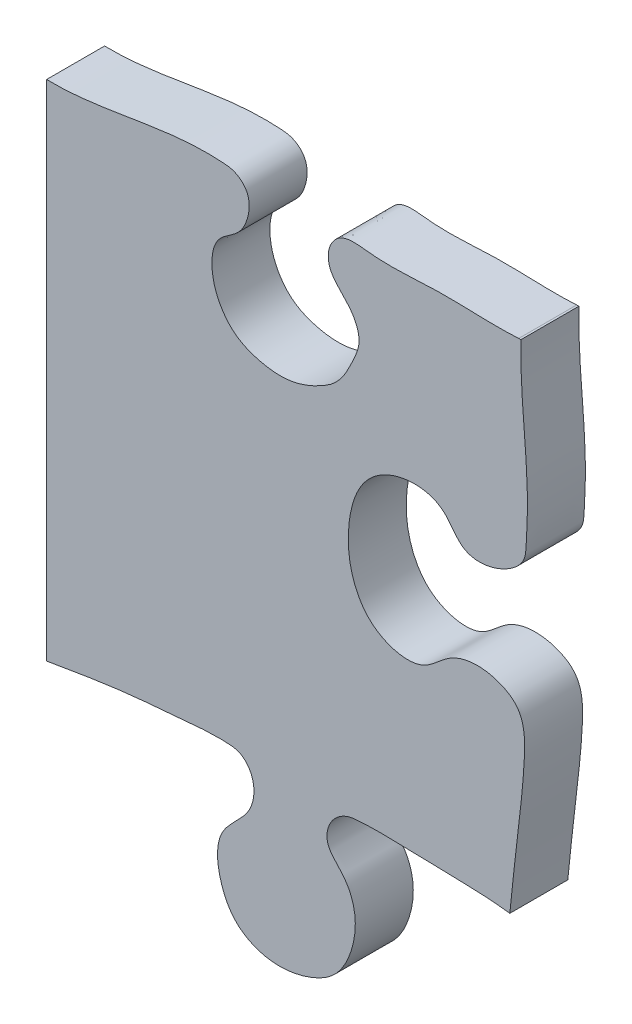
ISO-10303-21;
HEADER;
FILE_DESCRIPTION(('STEP AP214'),'2;1');
FILE_NAME('part.step','',(''),(''),'','','');
FILE_SCHEMA(('AUTOMOTIVE_DESIGN { 1 0 10303 214 1 1 1 1 }'));
ENDSEC;
DATA;
#1=APPLICATION_CONTEXT('core data for automotive mechanical design processes');
#2=APPLICATION_PROTOCOL_DEFINITION('international standard','automotive_design',2000,#1);
#3=PRODUCT_CONTEXT('',#1,'mechanical');
#4=PRODUCT('Part','Part','',(#3));
#5=PRODUCT_RELATED_PRODUCT_CATEGORY('part','',(#4));
#6=PRODUCT_DEFINITION_FORMATION('','',#4);
#7=PRODUCT_DEFINITION_CONTEXT('part definition',#1,'design');
#8=PRODUCT_DEFINITION('design','',#6,#7);
#9=PRODUCT_DEFINITION_SHAPE('','',#8);
#10=(LENGTH_UNIT() NAMED_UNIT(*) SI_UNIT(.MILLI.,.METRE.));
#11=(NAMED_UNIT(*) PLANE_ANGLE_UNIT() SI_UNIT($,.RADIAN.));
#12=(NAMED_UNIT(*) SI_UNIT($,.STERADIAN.) SOLID_ANGLE_UNIT());
#13=UNCERTAINTY_MEASURE_WITH_UNIT(LENGTH_MEASURE(1.E-05),#10,'distance_accuracy_value','');
#14=(GEOMETRIC_REPRESENTATION_CONTEXT(3) GLOBAL_UNCERTAINTY_ASSIGNED_CONTEXT((#13)) GLOBAL_UNIT_ASSIGNED_CONTEXT((#10,
#11,#12)) REPRESENTATION_CONTEXT('',''));
#15=CARTESIAN_POINT('',(0.,0.,0.));
#16=DIRECTION('',(0.,0.,1.));
#17=DIRECTION('',(1.,0.,0.));
#18=AXIS2_PLACEMENT_3D('',#15,#16,#17);
#19=CARTESIAN_POINT('',(-352.534626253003,356.,-0.00999999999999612));
#20=CARTESIAN_POINT('',(-353.877781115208,341.802611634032,-0.00999999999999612));
#21=CARTESIAN_POINT('',(-351.460483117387,322.567956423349,-0.00999999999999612));
#22=CARTESIAN_POINT('',(-355.747404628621,299.493999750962,-0.00999999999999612));
#23=CARTESIAN_POINT('',(-347.645743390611,289.357079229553,-0.00999999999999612));
#24=CARTESIAN_POINT('',(-337.80105524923,293.322704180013,-0.00999999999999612));
#25=CARTESIAN_POINT('',(-331.763521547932,304.464683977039,-0.00999999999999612));
#26=CARTESIAN_POINT('',(-312.737993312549,300.417040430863,-0.00999999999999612));
#27=CARTESIAN_POINT('',(-304.311514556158,284.867329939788,-0.00999999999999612));
#28=CARTESIAN_POINT('',(-301.362858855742,267.518539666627,-0.00999999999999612));
#29=CARTESIAN_POINT('',(-309.525260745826,253.299800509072,-0.00999999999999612));
#30=CARTESIAN_POINT('',(-323.085028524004,249.130779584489,-0.00999999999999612));
#31=CARTESIAN_POINT('',(-333.558735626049,254.453066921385,-0.00999999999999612));
#32=CARTESIAN_POINT('',(-338.061007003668,263.306234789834,-0.00999999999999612));
#33=CARTESIAN_POINT('',(-357.610347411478,266.663664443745,-0.00999999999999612));
#34=CARTESIAN_POINT('',(-352.91397083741,227.568949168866,-0.00999999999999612));
#35=CARTESIAN_POINT('',(-349.689076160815,203.209436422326,-0.00999999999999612));
#36=CARTESIAN_POINT('',(-346.386977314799,175.800103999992,-0.00999999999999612));
#37=CARTESIAN_POINT('',(-343.691373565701,150.269708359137,-0.00999999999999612));
#38=CARTESIAN_POINT('',(-342.931567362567,128.594211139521,-0.00999999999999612));
#39=CARTESIAN_POINT('',(-343.655360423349,107.633085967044,-0.00999999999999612));
#40=CARTESIAN_POINT('',(-357.389603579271,103.824438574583,-0.00999999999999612));
#41=CARTESIAN_POINT('',(-367.576419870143,106.015828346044,-0.00999999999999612));
#42=CARTESIAN_POINT('',(-371.765750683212,114.589953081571,-0.00999999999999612));
#43=CARTESIAN_POINT('',(-382.535012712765,116.182843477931,-0.00999999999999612));
#44=CARTESIAN_POINT('',(-394.783984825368,115.916744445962,-0.00999999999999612));
#45=CARTESIAN_POINT('',(-402.322369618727,104.396558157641,-0.00999999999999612));
#46=CARTESIAN_POINT('',(-405.688784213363,89.1486295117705,-0.00999999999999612));
#47=CARTESIAN_POINT('',(-402.964002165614,71.2455616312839,-0.00999999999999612));
#48=CARTESIAN_POINT('',(-389.022909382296,60.8761001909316,-0.00999999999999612));
#49=CARTESIAN_POINT('',(-377.013010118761,63.0649709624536,-0.00999999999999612));
#50=CARTESIAN_POINT('',(-370.136212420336,70.9200889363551,-0.00999999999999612));
#51=CARTESIAN_POINT('',(-359.248489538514,74.3793713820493,-0.00999999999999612));
#52=CARTESIAN_POINT('',(-347.964757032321,70.4189230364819,-0.00999999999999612));
#53=CARTESIAN_POINT('',(-342.961480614,58.8762689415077,-0.00999999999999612));
#54=CARTESIAN_POINT('',(-344.957853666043,42.6141567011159,-0.00999999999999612));
#55=CARTESIAN_POINT('',(-348.090347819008,20.9428011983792,-0.00999999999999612));
#56=CARTESIAN_POINT('',(-348.787112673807,-1.92187291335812,-0.00999999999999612));
#57=CARTESIAN_POINT('',(-347.063507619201,-23.1354473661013,-0.00999999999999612));
#58=CARTESIAN_POINT('',(-345.803834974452,-40.1989543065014,-0.00999999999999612));
#59=CARTESIAN_POINT('',(-346.365109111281,-52.5147126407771,-0.00999999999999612));
#60=CARTESIAN_POINT('',(-346.987719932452,-61.0081322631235,-0.00999999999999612));
#61=CARTESIAN_POINT('',(-354.605588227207,-67.8105997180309,-0.00999999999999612));
#62=CARTESIAN_POINT('',(-368.483652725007,-69.9483525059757,-0.00999999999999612));
#63=CARTESIAN_POINT('',(-374.929468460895,-56.6181815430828,-0.00999999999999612));
#64=CARTESIAN_POINT('',(-389.51528778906,-54.9578642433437,-0.00999999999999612));
#65=CARTESIAN_POINT('',(-403.927113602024,-62.7741481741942,-0.00999999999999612));
#66=CARTESIAN_POINT('',(-408.906740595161,-79.6272624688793,-0.00999999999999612));
#67=CARTESIAN_POINT('',(-407.354009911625,-95.181625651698,-0.00999999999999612));
#68=CARTESIAN_POINT('',(-399.108136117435,-108.127376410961,-0.00999999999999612));
#69=CARTESIAN_POINT('',(-382.721304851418,-112.332091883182,-0.00999999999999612));
#70=CARTESIAN_POINT('',(-372.627066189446,-99.6029758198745,-0.00999999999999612));
#71=CARTESIAN_POINT('',(-359.245942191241,-98.6507630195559,-0.00999999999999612));
#72=CARTESIAN_POINT('',(-346.811479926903,-105.357996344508,-0.00999999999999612));
#73=CARTESIAN_POINT('',(-347.06309899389,-122.824759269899,-0.00999999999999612));
#74=CARTESIAN_POINT('',(-349.512128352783,-142.867981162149,-0.00999999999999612));
#75=CARTESIAN_POINT('',(-351.967561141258,-164.813498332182,-0.00999999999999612));
#76=CARTESIAN_POINT('',(-354.173348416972,-189.531702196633,-0.00999999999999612));
#77=CARTESIAN_POINT('',(-353.048503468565,-212.668893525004,-0.00999999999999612));
#78=CARTESIAN_POINT('',(-354.739062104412,-232.840407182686,-0.00999999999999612));
#79=CARTESIAN_POINT('',(-344.245211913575,-244.921596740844,-0.00999999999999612));
#80=CARTESIAN_POINT('',(-336.376475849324,-237.735778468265,-0.00999999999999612));
#81=CARTESIAN_POINT('',(-333.938993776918,-228.321764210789,-0.00999999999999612));
#82=CARTESIAN_POINT('',(-321.423877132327,-226.689197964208,-0.00999999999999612));
#83=CARTESIAN_POINT('',(-310.83224361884,-232.911014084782,-0.00999999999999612));
#84=CARTESIAN_POINT('',(-302.540379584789,-246.611975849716,-0.00999999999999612));
#85=CARTESIAN_POINT('',(-304.049270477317,-262.348985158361,-0.00999999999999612));
#86=CARTESIAN_POINT('',(-307.19247660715,-276.895908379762,-0.00999999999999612));
#87=CARTESIAN_POINT('',(-317.916754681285,-281.774853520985,-0.00999999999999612));
#88=CARTESIAN_POINT('',(-328.48323529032,-282.130896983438,-0.00999999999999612));
#89=CARTESIAN_POINT('',(-335.177873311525,-274.391757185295,-0.00999999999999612));
#90=CARTESIAN_POINT('',(-340.967044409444,-267.020526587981,-0.00999999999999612));
#91=CARTESIAN_POINT('',(-352.493784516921,-268.657509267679,-0.00999999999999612));
#92=CARTESIAN_POINT('',(-357.686319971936,-282.822093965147,-0.00999999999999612));
#93=CARTESIAN_POINT('',(-357.597756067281,-311.53856504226,-0.00999999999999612));
#94=CARTESIAN_POINT('',(-355.656952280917,-337.76537977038,-0.00999999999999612));
#95=CARTESIAN_POINT('',(-354.035135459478,-356.,-0.00999999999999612));
#96=B_SPLINE_CURVE_WITH_KNOTS('',3,(#19,#20,#21,#22,#23,#24,#25,#26,#27,#28,#29,#30,#31,#32,#33,
#34,#35,#36,#37,#38,#39,#40,#41,#42,#43,#44,#45,#46,#47,#48,#49,#50,#51,#52,#53,#54,#55,#56,#57,
#58,#59,#60,#61,#62,#63,#64,#65,#66,#67,#68,#69,#70,#71,#72,#73,#74,#75,#76,#77,#78,#79,#80,#81,
#82,#83,#84,#85,#86,#87,#88,#89,#90,#91,#92,#93,#94,#95),.UNSPECIFIED.,.F.,.F.,(4,1,1,1,1,1,1,1,
1,1,1,1,1,1,1,1,1,1,1,1,1,1,1,1,1,1,1,1,1,1,1,1,1,1,1,1,1,1,1,1,1,1,1,1,1,1,1,1,1,1,1,1,1,1,1,1,
1,1,1,1,1,1,1,1,1,1,1,1,1,1,1,1,1,1,4),(0.,0.0362663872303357,0.0516957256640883,
0.0575126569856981,0.0656061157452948,0.0738542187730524,0.0886191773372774,0.103761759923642,
0.118344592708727,0.132658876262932,0.141706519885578,0.152628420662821,0.159936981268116,
0.166346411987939,0.196099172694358,0.222591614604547,0.242329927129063,0.265519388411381,
0.28892287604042,0.3014399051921,0.313339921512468,0.3200215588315,0.327007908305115,
0.335496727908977,0.346341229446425,0.356695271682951,0.367736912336,0.387395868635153,
0.399447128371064,0.408443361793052,0.416078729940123,0.425886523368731,0.4364139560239,
0.44355209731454,0.456701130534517,0.478081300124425,0.500737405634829,0.515722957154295,
0.53328305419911,0.545176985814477,0.547408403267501,0.555597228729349,0.568417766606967,
0.576959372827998,0.589646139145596,0.601337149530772,0.617107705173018,0.631663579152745,
0.64088779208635,0.655943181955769,0.666193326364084,0.679689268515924,0.687162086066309,
0.700019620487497,0.719317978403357,0.742088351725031,0.756487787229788,0.783860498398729,
0.801622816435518,0.8097052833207,0.815461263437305,0.824516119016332,0.833497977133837,
0.842909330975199,0.85562007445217,0.872330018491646,0.883598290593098,0.890881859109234,
0.901363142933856,0.908021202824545,0.916645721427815,0.924017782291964,0.933106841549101,
0.95201687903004,1.),.UNSPECIFIED.);
#97=DIRECTION('',(0.,0.,1.));
#98=VECTOR('',#97,1.);
#99=SURFACE_OF_LINEAR_EXTRUSION('',#96,#98);
#100=CARTESIAN_POINT('',(-352.534626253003,356.,20.));
#101=CARTESIAN_POINT('',(-353.877781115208,341.802611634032,20.));
#102=CARTESIAN_POINT('',(-351.460483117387,322.567956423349,20.));
#103=CARTESIAN_POINT('',(-355.747404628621,299.493999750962,20.));
#104=CARTESIAN_POINT('',(-347.645743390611,289.357079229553,20.));
#105=CARTESIAN_POINT('',(-337.80105524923,293.322704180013,20.));
#106=CARTESIAN_POINT('',(-331.763521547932,304.464683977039,20.));
#107=CARTESIAN_POINT('',(-312.737993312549,300.417040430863,20.));
#108=CARTESIAN_POINT('',(-304.311514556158,284.867329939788,20.));
#109=CARTESIAN_POINT('',(-301.362858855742,267.518539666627,20.));
#110=CARTESIAN_POINT('',(-309.525260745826,253.299800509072,20.));
#111=CARTESIAN_POINT('',(-323.085028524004,249.130779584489,20.));
#112=CARTESIAN_POINT('',(-333.558735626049,254.453066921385,20.));
#113=CARTESIAN_POINT('',(-338.061007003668,263.306234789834,20.));
#114=CARTESIAN_POINT('',(-357.610347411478,266.663664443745,20.));
#115=CARTESIAN_POINT('',(-352.91397083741,227.568949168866,20.));
#116=CARTESIAN_POINT('',(-349.689076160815,203.209436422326,20.));
#117=CARTESIAN_POINT('',(-346.386977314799,175.800103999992,20.));
#118=CARTESIAN_POINT('',(-343.691373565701,150.269708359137,20.));
#119=CARTESIAN_POINT('',(-342.931567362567,128.594211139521,20.));
#120=CARTESIAN_POINT('',(-343.655360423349,107.633085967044,20.));
#121=CARTESIAN_POINT('',(-357.389603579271,103.824438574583,20.));
#122=CARTESIAN_POINT('',(-367.576419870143,106.015828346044,20.));
#123=CARTESIAN_POINT('',(-371.765750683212,114.589953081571,20.));
#124=CARTESIAN_POINT('',(-382.535012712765,116.182843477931,20.));
#125=CARTESIAN_POINT('',(-394.783984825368,115.916744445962,20.));
#126=CARTESIAN_POINT('',(-402.322369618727,104.396558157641,20.));
#127=CARTESIAN_POINT('',(-405.688784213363,89.1486295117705,20.));
#128=CARTESIAN_POINT('',(-402.964002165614,71.2455616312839,20.));
#129=CARTESIAN_POINT('',(-389.022909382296,60.8761001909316,20.));
#130=CARTESIAN_POINT('',(-377.013010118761,63.0649709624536,20.));
#131=CARTESIAN_POINT('',(-370.136212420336,70.9200889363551,20.));
#132=CARTESIAN_POINT('',(-359.248489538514,74.3793713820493,20.));
#133=CARTESIAN_POINT('',(-347.964757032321,70.4189230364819,20.));
#134=CARTESIAN_POINT('',(-342.961480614,58.8762689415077,20.));
#135=CARTESIAN_POINT('',(-344.957853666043,42.6141567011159,20.));
#136=CARTESIAN_POINT('',(-348.090347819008,20.9428011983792,20.));
#137=CARTESIAN_POINT('',(-348.787112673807,-1.92187291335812,20.));
#138=CARTESIAN_POINT('',(-347.063507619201,-23.1354473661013,20.));
#139=CARTESIAN_POINT('',(-345.803834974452,-40.1989543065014,20.));
#140=CARTESIAN_POINT('',(-346.365109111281,-52.5147126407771,20.));
#141=CARTESIAN_POINT('',(-346.987719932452,-61.0081322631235,20.));
#142=CARTESIAN_POINT('',(-354.605588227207,-67.8105997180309,20.));
#143=CARTESIAN_POINT('',(-368.483652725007,-69.9483525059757,20.));
#144=CARTESIAN_POINT('',(-374.929468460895,-56.6181815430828,20.));
#145=CARTESIAN_POINT('',(-389.51528778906,-54.9578642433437,20.));
#146=CARTESIAN_POINT('',(-403.927113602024,-62.7741481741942,20.));
#147=CARTESIAN_POINT('',(-408.906740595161,-79.6272624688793,20.));
#148=CARTESIAN_POINT('',(-407.354009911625,-95.181625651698,20.));
#149=CARTESIAN_POINT('',(-399.108136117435,-108.127376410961,20.));
#150=CARTESIAN_POINT('',(-382.721304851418,-112.332091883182,20.));
#151=CARTESIAN_POINT('',(-372.627066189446,-99.6029758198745,20.));
#152=CARTESIAN_POINT('',(-359.245942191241,-98.6507630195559,20.));
#153=CARTESIAN_POINT('',(-346.811479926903,-105.357996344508,20.));
#154=CARTESIAN_POINT('',(-347.06309899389,-122.824759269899,20.));
#155=CARTESIAN_POINT('',(-349.512128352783,-142.867981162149,20.));
#156=CARTESIAN_POINT('',(-351.967561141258,-164.813498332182,20.));
#157=CARTESIAN_POINT('',(-354.173348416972,-189.531702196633,20.));
#158=CARTESIAN_POINT('',(-353.048503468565,-212.668893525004,20.));
#159=CARTESIAN_POINT('',(-354.739062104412,-232.840407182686,20.));
#160=CARTESIAN_POINT('',(-344.245211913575,-244.921596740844,20.));
#161=CARTESIAN_POINT('',(-336.376475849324,-237.735778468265,20.));
#162=CARTESIAN_POINT('',(-333.938993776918,-228.321764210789,20.));
#163=CARTESIAN_POINT('',(-321.423877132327,-226.689197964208,20.));
#164=CARTESIAN_POINT('',(-310.83224361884,-232.911014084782,20.));
#165=CARTESIAN_POINT('',(-302.540379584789,-246.611975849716,20.));
#166=CARTESIAN_POINT('',(-304.049270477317,-262.348985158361,20.));
#167=CARTESIAN_POINT('',(-307.19247660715,-276.895908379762,20.));
#168=CARTESIAN_POINT('',(-317.916754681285,-281.774853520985,20.));
#169=CARTESIAN_POINT('',(-328.48323529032,-282.130896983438,20.));
#170=CARTESIAN_POINT('',(-335.177873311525,-274.391757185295,20.));
#171=CARTESIAN_POINT('',(-340.967044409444,-267.020526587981,20.));
#172=CARTESIAN_POINT('',(-352.493784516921,-268.657509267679,20.));
#173=CARTESIAN_POINT('',(-357.686319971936,-282.822093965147,20.));
#174=CARTESIAN_POINT('',(-357.597756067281,-311.53856504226,20.));
#175=CARTESIAN_POINT('',(-355.656952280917,-337.76537977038,20.));
#176=CARTESIAN_POINT('',(-354.035135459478,-356.,20.));
#177=B_SPLINE_CURVE_WITH_KNOTS('',3,(#100,#101,#102,#103,#104,#105,#106,#107,#108,#109,#110,
#111,#112,#113,#114,#115,#116,#117,#118,#119,#120,#121,#122,#123,#124,#125,#126,#127,#128,#129,
#130,#131,#132,#133,#134,#135,#136,#137,#138,#139,#140,#141,#142,#143,#144,#145,#146,#147,#148,
#149,#150,#151,#152,#153,#154,#155,#156,#157,#158,#159,#160,#161,#162,#163,#164,#165,#166,#167,
#168,#169,#170,#171,#172,#173,#174,#175,#176),.UNSPECIFIED.,.F.,.F.,(4,1,1,1,1,1,1,1,1,1,1,1,1,
1,1,1,1,1,1,1,1,1,1,1,1,1,1,1,1,1,1,1,1,1,1,1,1,1,1,1,1,1,1,1,1,1,1,1,1,1,1,1,1,1,1,1,1,1,1,1,1,
1,1,1,1,1,1,1,1,1,1,1,1,1,4),(0.,0.0362663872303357,0.0516957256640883,0.0575126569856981,
0.0656061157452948,0.0738542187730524,0.0886191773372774,0.103761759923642,0.118344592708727,
0.132658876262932,0.141706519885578,0.152628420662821,0.159936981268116,0.166346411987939,
0.196099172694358,0.222591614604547,0.242329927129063,0.265519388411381,0.28892287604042,
0.3014399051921,0.313339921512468,0.3200215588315,0.327007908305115,0.335496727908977,
0.346341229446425,0.356695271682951,0.367736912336,0.387395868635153,0.399447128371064,
0.408443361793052,0.416078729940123,0.425886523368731,0.4364139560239,0.44355209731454,
0.456701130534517,0.478081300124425,0.500737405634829,0.515722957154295,0.53328305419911,
0.545176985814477,0.547408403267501,0.555597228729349,0.568417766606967,0.576959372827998,
0.589646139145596,0.601337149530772,0.617107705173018,0.631663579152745,0.64088779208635,
0.655943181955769,0.666193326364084,0.679689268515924,0.687162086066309,0.700019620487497,
0.719317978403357,0.742088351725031,0.756487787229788,0.783860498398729,0.801622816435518,
0.8097052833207,0.815461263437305,0.824516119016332,0.833497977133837,0.842909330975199,
0.85562007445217,0.872330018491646,0.883598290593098,0.890881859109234,0.901363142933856,
0.908021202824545,0.916645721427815,0.924017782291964,0.933106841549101,0.95201687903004,1.),.UNSPECIFIED.);
#178=CARTESIAN_POINT('',(-348.40314200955,5.28695656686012,20.));
#179=VERTEX_POINT('',#178);
#180=CARTESIAN_POINT('',(-352.201722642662,-167.987791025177,20.));
#181=VERTEX_POINT('',#180);
#182=EDGE_CURVE('E94',#179,#181,#177,.T.);
#183=ORIENTED_EDGE('',*,*,#182,.T.);
#184=DIRECTION('',(0.,0.,1.));
#185=VECTOR('',#184,1.);
#186=CARTESIAN_POINT('',(-352.201722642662,-167.987791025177,-0.00999999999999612));
#187=LINE('',#186,#185);
#188=CARTESIAN_POINT('',(-352.201722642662,-167.987791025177,0.));
#189=VERTEX_POINT('',#188);
#190=EDGE_CURVE('E86',#181,#189,#187,.F.);
#191=ORIENTED_EDGE('',*,*,#190,.T.);
#192=CARTESIAN_POINT('',(-352.534626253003,356.,0.));
#193=CARTESIAN_POINT('',(-353.877781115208,341.802611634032,0.));
#194=CARTESIAN_POINT('',(-351.460483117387,322.567956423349,0.));
#195=CARTESIAN_POINT('',(-355.747404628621,299.493999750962,0.));
#196=CARTESIAN_POINT('',(-347.645743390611,289.357079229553,0.));
#197=CARTESIAN_POINT('',(-337.80105524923,293.322704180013,0.));
#198=CARTESIAN_POINT('',(-331.763521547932,304.464683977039,0.));
#199=CARTESIAN_POINT('',(-312.737993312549,300.417040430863,0.));
#200=CARTESIAN_POINT('',(-304.311514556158,284.867329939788,0.));
#201=CARTESIAN_POINT('',(-301.362858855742,267.518539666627,0.));
#202=CARTESIAN_POINT('',(-309.525260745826,253.299800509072,0.));
#203=CARTESIAN_POINT('',(-323.085028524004,249.130779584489,0.));
#204=CARTESIAN_POINT('',(-333.558735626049,254.453066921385,0.));
#205=CARTESIAN_POINT('',(-338.061007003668,263.306234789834,0.));
#206=CARTESIAN_POINT('',(-357.610347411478,266.663664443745,0.));
#207=CARTESIAN_POINT('',(-352.91397083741,227.568949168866,0.));
#208=CARTESIAN_POINT('',(-349.689076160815,203.209436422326,0.));
#209=CARTESIAN_POINT('',(-346.386977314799,175.800103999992,0.));
#210=CARTESIAN_POINT('',(-343.691373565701,150.269708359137,0.));
#211=CARTESIAN_POINT('',(-342.931567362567,128.594211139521,0.));
#212=CARTESIAN_POINT('',(-343.655360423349,107.633085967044,0.));
#213=CARTESIAN_POINT('',(-357.389603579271,103.824438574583,0.));
#214=CARTESIAN_POINT('',(-367.576419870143,106.015828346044,0.));
#215=CARTESIAN_POINT('',(-371.765750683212,114.589953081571,0.));
#216=CARTESIAN_POINT('',(-382.535012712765,116.182843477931,0.));
#217=CARTESIAN_POINT('',(-394.783984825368,115.916744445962,0.));
#218=CARTESIAN_POINT('',(-402.322369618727,104.396558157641,0.));
#219=CARTESIAN_POINT('',(-405.688784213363,89.1486295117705,0.));
#220=CARTESIAN_POINT('',(-402.964002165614,71.2455616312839,0.));
#221=CARTESIAN_POINT('',(-389.022909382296,60.8761001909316,0.));
#222=CARTESIAN_POINT('',(-377.013010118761,63.0649709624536,0.));
#223=CARTESIAN_POINT('',(-370.136212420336,70.9200889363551,0.));
#224=CARTESIAN_POINT('',(-359.248489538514,74.3793713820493,0.));
#225=CARTESIAN_POINT('',(-347.964757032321,70.4189230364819,0.));
#226=CARTESIAN_POINT('',(-342.961480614,58.8762689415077,0.));
#227=CARTESIAN_POINT('',(-344.957853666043,42.6141567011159,0.));
#228=CARTESIAN_POINT('',(-348.090347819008,20.9428011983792,0.));
#229=CARTESIAN_POINT('',(-348.787112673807,-1.92187291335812,0.));
#230=CARTESIAN_POINT('',(-347.063507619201,-23.1354473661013,0.));
#231=CARTESIAN_POINT('',(-345.803834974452,-40.1989543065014,0.));
#232=CARTESIAN_POINT('',(-346.365109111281,-52.5147126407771,0.));
#233=CARTESIAN_POINT('',(-346.987719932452,-61.0081322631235,0.));
#234=CARTESIAN_POINT('',(-354.605588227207,-67.8105997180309,0.));
#235=CARTESIAN_POINT('',(-368.483652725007,-69.9483525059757,0.));
#236=CARTESIAN_POINT('',(-374.929468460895,-56.6181815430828,0.));
#237=CARTESIAN_POINT('',(-389.51528778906,-54.9578642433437,0.));
#238=CARTESIAN_POINT('',(-403.927113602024,-62.7741481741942,0.));
#239=CARTESIAN_POINT('',(-408.906740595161,-79.6272624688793,0.));
#240=CARTESIAN_POINT('',(-407.354009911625,-95.181625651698,0.));
#241=CARTESIAN_POINT('',(-399.108136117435,-108.127376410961,0.));
#242=CARTESIAN_POINT('',(-382.721304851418,-112.332091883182,0.));
#243=CARTESIAN_POINT('',(-372.627066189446,-99.6029758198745,0.));
#244=CARTESIAN_POINT('',(-359.245942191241,-98.6507630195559,0.));
#245=CARTESIAN_POINT('',(-346.811479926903,-105.357996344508,0.));
#246=CARTESIAN_POINT('',(-347.06309899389,-122.824759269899,0.));
#247=CARTESIAN_POINT('',(-349.512128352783,-142.867981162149,0.));
#248=CARTESIAN_POINT('',(-351.967561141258,-164.813498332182,0.));
#249=CARTESIAN_POINT('',(-354.173348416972,-189.531702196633,0.));
#250=CARTESIAN_POINT('',(-353.048503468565,-212.668893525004,0.));
#251=CARTESIAN_POINT('',(-354.739062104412,-232.840407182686,0.));
#252=CARTESIAN_POINT('',(-344.245211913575,-244.921596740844,0.));
#253=CARTESIAN_POINT('',(-336.376475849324,-237.735778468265,0.));
#254=CARTESIAN_POINT('',(-333.938993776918,-228.321764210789,0.));
#255=CARTESIAN_POINT('',(-321.423877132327,-226.689197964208,0.));
#256=CARTESIAN_POINT('',(-310.83224361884,-232.911014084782,0.));
#257=CARTESIAN_POINT('',(-302.540379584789,-246.611975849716,0.));
#258=CARTESIAN_POINT('',(-304.049270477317,-262.348985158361,0.));
#259=CARTESIAN_POINT('',(-307.19247660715,-276.895908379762,0.));
#260=CARTESIAN_POINT('',(-317.916754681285,-281.774853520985,0.));
#261=CARTESIAN_POINT('',(-328.48323529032,-282.130896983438,0.));
#262=CARTESIAN_POINT('',(-335.177873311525,-274.391757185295,0.));
#263=CARTESIAN_POINT('',(-340.967044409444,-267.020526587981,0.));
#264=CARTESIAN_POINT('',(-352.493784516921,-268.657509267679,0.));
#265=CARTESIAN_POINT('',(-357.686319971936,-282.822093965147,0.));
#266=CARTESIAN_POINT('',(-357.597756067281,-311.53856504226,0.));
#267=CARTESIAN_POINT('',(-355.656952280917,-337.76537977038,0.));
#268=CARTESIAN_POINT('',(-354.035135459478,-356.,0.));
#269=B_SPLINE_CURVE_WITH_KNOTS('',3,(#192,#193,#194,#195,#196,#197,#198,#199,#200,#201,#202,
#203,#204,#205,#206,#207,#208,#209,#210,#211,#212,#213,#214,#215,#216,#217,#218,#219,#220,#221,
#222,#223,#224,#225,#226,#227,#228,#229,#230,#231,#232,#233,#234,#235,#236,#237,#238,#239,#240,
#241,#242,#243,#244,#245,#246,#247,#248,#249,#250,#251,#252,#253,#254,#255,#256,#257,#258,#259,
#260,#261,#262,#263,#264,#265,#266,#267,#268),.UNSPECIFIED.,.F.,.F.,(4,1,1,1,1,1,1,1,1,1,1,1,1,
1,1,1,1,1,1,1,1,1,1,1,1,1,1,1,1,1,1,1,1,1,1,1,1,1,1,1,1,1,1,1,1,1,1,1,1,1,1,1,1,1,1,1,1,1,1,1,1,
1,1,1,1,1,1,1,1,1,1,1,1,1,4),(0.,0.0362663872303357,0.0516957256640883,0.0575126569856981,
0.0656061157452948,0.0738542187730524,0.0886191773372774,0.103761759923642,0.118344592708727,
0.132658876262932,0.141706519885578,0.152628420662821,0.159936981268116,0.166346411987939,
0.196099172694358,0.222591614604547,0.242329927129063,0.265519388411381,0.28892287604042,
0.3014399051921,0.313339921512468,0.3200215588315,0.327007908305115,0.335496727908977,
0.346341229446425,0.356695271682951,0.367736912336,0.387395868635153,0.399447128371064,
0.408443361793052,0.416078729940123,0.425886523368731,0.4364139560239,0.44355209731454,
0.456701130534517,0.478081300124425,0.500737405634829,0.515722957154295,0.53328305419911,
0.545176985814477,0.547408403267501,0.555597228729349,0.568417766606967,0.576959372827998,
0.589646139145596,0.601337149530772,0.617107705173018,0.631663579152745,0.64088779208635,
0.655943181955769,0.666193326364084,0.679689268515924,0.687162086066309,0.700019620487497,
0.719317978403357,0.742088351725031,0.756487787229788,0.783860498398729,0.801622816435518,
0.8097052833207,0.815461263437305,0.824516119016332,0.833497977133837,0.842909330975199,
0.85562007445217,0.872330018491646,0.883598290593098,0.890881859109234,0.901363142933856,
0.908021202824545,0.916645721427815,0.924017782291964,0.933106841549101,0.95201687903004,1.),.UNSPECIFIED.);
#270=CARTESIAN_POINT('',(-348.40314200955,5.28695656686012,0.));
#271=VERTEX_POINT('',#270);
#272=EDGE_CURVE('E140',#271,#189,#269,.T.);
#273=ORIENTED_EDGE('',*,*,#272,.F.);
#274=DIRECTION('',(0.,0.,1.));
#275=VECTOR('',#274,1.);
#276=CARTESIAN_POINT('',(-348.403142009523,5.28695656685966,-0.00999999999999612));
#277=LINE('',#276,#275);
#278=EDGE_CURVE('E93',#179,#271,#277,.F.);
#279=ORIENTED_EDGE('',*,*,#278,.F.);
#280=EDGE_LOOP('',(#183,#191,#273,#279));
#281=FACE_BOUND('',#280,.T.);
#282=ADVANCED_FACE('F34',(#281),#99,.F.);
#283=CARTESIAN_POINT('',(-349.139880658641,5.30046994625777,-0.00999999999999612));
#284=CARTESIAN_POINT('',(-339.887860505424,5.11479546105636,-0.00999999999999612));
#285=CARTESIAN_POINT('',(-319.891606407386,5.70075392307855,-0.00999999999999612));
#286=CARTESIAN_POINT('',(-312.057252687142,6.39377361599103,-0.00999999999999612));
#287=CARTESIAN_POINT('',(-295.557040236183,6.5821024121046,-0.00999999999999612));
#288=CARTESIAN_POINT('',(-287.520649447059,5.38238329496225,-0.00999999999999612));
#289=CARTESIAN_POINT('',(-282.231232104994,-0.739375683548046,-0.00999999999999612));
#290=CARTESIAN_POINT('',(-284.631758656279,-6.70157001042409,-0.00999999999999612));
#291=CARTESIAN_POINT('',(-290.291633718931,-11.4270553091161,-0.00999999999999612));
#292=CARTESIAN_POINT('',(-294.264404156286,-19.1154923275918,-0.00999999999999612));
#293=CARTESIAN_POINT('',(-294.324045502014,-31.0075730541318,-0.00999999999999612));
#294=CARTESIAN_POINT('',(-285.696757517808,-42.2618535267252,-0.00999999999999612));
#295=CARTESIAN_POINT('',(-271.389959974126,-47.4058055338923,-0.00999999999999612));
#296=CARTESIAN_POINT('',(-259.358947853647,-47.5927514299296,-0.00999999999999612));
#297=CARTESIAN_POINT('',(-248.949507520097,-41.269541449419,-0.00999999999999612));
#298=CARTESIAN_POINT('',(-243.879910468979,-32.2576865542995,-0.00999999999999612));
#299=CARTESIAN_POINT('',(-242.928014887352,-21.7896256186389,-0.00999999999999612));
#300=CARTESIAN_POINT('',(-249.227477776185,-14.851631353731,-0.00999999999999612));
#301=CARTESIAN_POINT('',(-254.593465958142,-9.43942563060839,-0.00999999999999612));
#302=CARTESIAN_POINT('',(-258.137345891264,-1.50662300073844,-0.00999999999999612));
#303=CARTESIAN_POINT('',(-253.898534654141,5.55474508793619,-0.00999999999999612));
#304=CARTESIAN_POINT('',(-243.567188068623,7.43755302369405,-0.00999999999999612));
#305=CARTESIAN_POINT('',(-237.879490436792,6.8669695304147,-0.00999999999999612));
#306=CARTESIAN_POINT('',(-212.535663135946,4.31355413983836,-0.00999999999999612));
#307=CARTESIAN_POINT('',(-204.857637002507,3.06770049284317,-0.00999999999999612));
#308=CARTESIAN_POINT('',(-187.870824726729,0.576823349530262,-0.00999999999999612));
#309=CARTESIAN_POINT('',(-180.873341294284,-0.585089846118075,-0.00999999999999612));
#310=CARTESIAN_POINT('',(-167.321297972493,-4.05861827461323,-0.00999999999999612));
#311=CARTESIAN_POINT('',(-158.264072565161,-5.81322262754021,-0.00999999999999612));
#312=CARTESIAN_POINT('',(-139.329328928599,-8.34288673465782,-0.00999999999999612));
#313=CARTESIAN_POINT('',(-132.040798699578,-2.9845391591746,-0.00999999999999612));
#314=CARTESIAN_POINT('',(-129.761885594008,4.23046807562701,-0.00999999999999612));
#315=CARTESIAN_POINT('',(-131.710784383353,10.4013258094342,-0.00999999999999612));
#316=CARTESIAN_POINT('',(-133.710968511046,14.6601816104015,-0.00999999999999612));
#317=CARTESIAN_POINT('',(-138.026269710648,21.724753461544,-0.00999999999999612));
#318=CARTESIAN_POINT('',(-138.081917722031,32.3728530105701,-0.00999999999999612));
#319=CARTESIAN_POINT('',(-131.83570692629,43.0815337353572,-0.00999999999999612));
#320=CARTESIAN_POINT('',(-119.794248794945,47.304204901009,-0.00999999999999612));
#321=CARTESIAN_POINT('',(-108.957899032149,47.5382470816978,-0.00999999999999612));
#322=CARTESIAN_POINT('',(-96.8719484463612,45.7015776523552,-0.00999999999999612));
#323=CARTESIAN_POINT('',(-87.0853124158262,37.0457421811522,-0.00999999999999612));
#324=CARTESIAN_POINT('',(-87.3806461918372,25.6113797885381,-0.00999999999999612));
#325=CARTESIAN_POINT('',(-91.1138584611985,18.4470720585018,-0.00999999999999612));
#326=CARTESIAN_POINT('',(-96.1690771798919,13.9582424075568,-0.00999999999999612));
#327=CARTESIAN_POINT('',(-97.7539111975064,6.63580226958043,-0.00999999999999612));
#328=CARTESIAN_POINT('',(-93.1531213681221,0.225805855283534,-0.00999999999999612));
#329=CARTESIAN_POINT('',(-85.7868945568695,-4.22125029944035,-0.00999999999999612));
#330=CARTESIAN_POINT('',(-75.4922823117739,-4.72742713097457,-0.00999999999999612));
#331=CARTESIAN_POINT('',(-63.6021774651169,-3.739894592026,-0.00999999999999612));
#332=CARTESIAN_POINT('',(-47.1576847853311,-2.15281130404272,-0.00999999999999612));
#333=CARTESIAN_POINT('',(-35.4735305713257,-1.02782701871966,-0.00999999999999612));
#334=CARTESIAN_POINT('',(-9.55974097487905,5.44923466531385,-0.00999999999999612));
#335=CARTESIAN_POINT('',(5.33335319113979,5.64341864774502,-0.00999999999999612));
#336=CARTESIAN_POINT('',(26.8877087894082,6.61154693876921,-0.00999999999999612));
#337=CARTESIAN_POINT('',(40.3616385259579,6.66752296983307,-0.00999999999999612));
#338=CARTESIAN_POINT('',(55.4069140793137,6.55682515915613,-0.00999999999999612));
#339=CARTESIAN_POINT('',(60.9823316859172,-1.76204700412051,-0.00999999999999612));
#340=CARTESIAN_POINT('',(62.7286219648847,-10.7101888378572,-0.00999999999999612));
#341=CARTESIAN_POINT('',(58.0719160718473,-18.2162229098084,-0.00999999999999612));
#342=CARTESIAN_POINT('',(50.4934538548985,-22.6369036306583,-0.00999999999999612));
#343=CARTESIAN_POINT('',(49.5191525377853,-32.4601424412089,-0.00999999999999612));
#344=CARTESIAN_POINT('',(50.9102608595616,-43.3041677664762,-0.00999999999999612));
#345=CARTESIAN_POINT('',(60.9494806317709,-51.7611152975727,-0.00999999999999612));
#346=CARTESIAN_POINT('',(73.8438777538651,-54.9427485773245,-0.00999999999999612));
#347=CARTESIAN_POINT('',(86.4324503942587,-54.0451489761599,-0.00999999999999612));
#348=CARTESIAN_POINT('',(96.2763408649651,-49.8211627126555,-0.00999999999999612));
#349=CARTESIAN_POINT('',(101.788676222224,-42.6926438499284,-0.00999999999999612));
#350=CARTESIAN_POINT('',(103.785622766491,-33.9307441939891,-0.00999999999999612));
#351=CARTESIAN_POINT('',(101.793989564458,-26.0744158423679,-0.00999999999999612));
#352=CARTESIAN_POINT('',(95.2302198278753,-18.82812621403,-0.00999999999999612));
#353=CARTESIAN_POINT('',(89.6165079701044,-10.8535457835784,-0.00999999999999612));
#354=CARTESIAN_POINT('',(88.5833289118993,0.119561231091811,-0.00999999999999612));
#355=CARTESIAN_POINT('',(98.1406475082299,6.80161389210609,-0.00999999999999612));
#356=CARTESIAN_POINT('',(110.075702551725,4.83412068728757,-0.00999999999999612));
#357=CARTESIAN_POINT('',(121.713926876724,4.79342247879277,-0.00999999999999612));
#358=CARTESIAN_POINT('',(136.161134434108,3.20442078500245,-0.00999999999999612));
#359=CARTESIAN_POINT('',(149.301551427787,2.24618232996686,-0.00999999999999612));
#360=CARTESIAN_POINT('',(163.635697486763,1.11607382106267,-0.00999999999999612));
#361=CARTESIAN_POINT('',(175.743984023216,-0.930199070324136,-0.00999999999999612));
#362=CARTESIAN_POINT('',(193.50042565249,-4.03526402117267,-0.00999999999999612));
#363=CARTESIAN_POINT('',(199.307125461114,-4.82007249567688,-0.00999999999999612));
#364=CARTESIAN_POINT('',(223.191668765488,-7.20796265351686,-0.00999999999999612));
#365=CARTESIAN_POINT('',(234.005762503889,-7.89583073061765,-0.00999999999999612));
#366=CARTESIAN_POINT('',(243.165304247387,-4.21144732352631,-0.00999999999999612));
#367=CARTESIAN_POINT('',(242.728227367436,5.29385628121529,-0.00999999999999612));
#368=CARTESIAN_POINT('',(239.691190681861,13.3923508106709,-0.00999999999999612));
#369=CARTESIAN_POINT('',(230.992924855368,17.259551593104,-0.00999999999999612));
#370=CARTESIAN_POINT('',(228.562234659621,35.6530691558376,-0.00999999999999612));
#371=CARTESIAN_POINT('',(241.485133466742,51.1639498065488,-0.00999999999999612));
#372=CARTESIAN_POINT('',(261.294428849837,50.4989765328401,-0.00999999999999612));
#373=CARTESIAN_POINT('',(273.311157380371,41.2796485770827,-0.00999999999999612));
#374=CARTESIAN_POINT('',(278.244185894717,29.7939334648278,-0.00999999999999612));
#375=CARTESIAN_POINT('',(278.46311043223,19.1716807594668,-0.00999999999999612));
#376=CARTESIAN_POINT('',(273.41239647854,11.7823053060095,-0.00999999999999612));
#377=CARTESIAN_POINT('',(269.462797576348,8.07180362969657,-0.00999999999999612));
#378=CARTESIAN_POINT('',(268.275297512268,1.27447756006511,-0.00999999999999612));
#379=CARTESIAN_POINT('',(269.56536006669,-2.1294813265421,-0.00999999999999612));
#380=CARTESIAN_POINT('',(273.239630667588,-8.77034024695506,-0.00999999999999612));
#381=CARTESIAN_POINT('',(289.550418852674,-6.96961632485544,-0.00999999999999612));
#382=CARTESIAN_POINT('',(304.280714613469,-6.71047567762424,-0.00999999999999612));
#383=CARTESIAN_POINT('',(324.326281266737,-6.23084088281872,-0.00999999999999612));
#384=CARTESIAN_POINT('',(349.235083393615,-7.00547217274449,-0.00999999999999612));
#385=CARTESIAN_POINT('',(375.517421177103,-8.89168640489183,-0.00999999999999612));
#386=CARTESIAN_POINT('',(398.91687007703,-8.79198570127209,-0.00999999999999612));
#387=CARTESIAN_POINT('',(415.173568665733,-7.26147865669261,-0.00999999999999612));
#388=CARTESIAN_POINT('',(418.590464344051,2.48372200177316,-0.00999999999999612));
#389=CARTESIAN_POINT('',(414.376255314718,7.33198876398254,-0.00999999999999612));
#390=CARTESIAN_POINT('',(409.420059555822,12.1922927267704,-0.00999999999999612));
#391=CARTESIAN_POINT('',(403.982345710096,21.0196469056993,-0.00999999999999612));
#392=CARTESIAN_POINT('',(405.486454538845,34.4252863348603,-0.00999999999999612));
#393=CARTESIAN_POINT('',(417.292648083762,42.4744659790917,-0.00999999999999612));
#394=CARTESIAN_POINT('',(430.971964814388,44.2079105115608,-0.00999999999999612));
#395=CARTESIAN_POINT('',(444.367703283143,42.5130395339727,-0.00999999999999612));
#396=CARTESIAN_POINT('',(452.635026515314,34.8362400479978,-0.00999999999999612));
#397=CARTESIAN_POINT('',(459.310429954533,27.5027807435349,-0.00999999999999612));
#398=CARTESIAN_POINT('',(458.249050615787,18.2902890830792,-0.00999999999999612));
#399=CARTESIAN_POINT('',(455.302955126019,10.0877891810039,-0.00999999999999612));
#400=CARTESIAN_POINT('',(448.406360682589,8.30941704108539,-0.00999999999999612));
#401=CARTESIAN_POINT('',(446.811865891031,2.1759580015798,-0.00999999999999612));
#402=CARTESIAN_POINT('',(451.102211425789,-2.40101244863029,-0.00999999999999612));
#403=CARTESIAN_POINT('',(456.533203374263,-6.13416812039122,-0.00999999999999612));
#404=CARTESIAN_POINT('',(468.262453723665,-6.69921981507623,-0.00999999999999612));
#405=CARTESIAN_POINT('',(486.320062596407,-6.06999038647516,-0.00999999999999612));
#406=CARTESIAN_POINT('',(502.630044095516,-5.50396307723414,-0.00999999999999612));
#407=CARTESIAN_POINT('',(512.,-5.81701820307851,-0.00999999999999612));
#408=B_SPLINE_CURVE_WITH_KNOTS('',3,(#283,#284,#285,#286,#287,#288,#289,#290,#291,#292,#293,
#294,#295,#296,#297,#298,#299,#300,#301,#302,#303,#304,#305,#306,#307,#308,#309,#310,#311,#312,
#313,#314,#315,#316,#317,#318,#319,#320,#321,#322,#323,#324,#325,#326,#327,#328,#329,#330,#331,
#332,#333,#334,#335,#336,#337,#338,#339,#340,#341,#342,#343,#344,#345,#346,#347,#348,#349,#350,
#351,#352,#353,#354,#355,#356,#357,#358,#359,#360,#361,#362,#363,#364,#365,#366,#367,#368,#369,
#370,#371,#372,#373,#374,#375,#376,#377,#378,#379,#380,#381,#382,#383,#384,#385,#386,#387,#388,
#389,#390,#391,#392,#393,#394,#395,#396,#397,#398,#399,#400,#401,#402,#403,#404,#405,#406,#407),
.UNSPECIFIED.,.F.,.F.,(4,1,1,1,1,1,1,1,1,1,1,1,1,1,1,1,1,1,1,1,1,1,1,1,1,1,1,1,1,1,1,1,1,1,1,1,
1,1,1,1,1,1,1,1,1,1,1,1,1,1,1,1,1,1,1,1,1,1,1,1,1,1,1,1,1,1,1,1,1,1,1,1,1,1,1,1,1,1,1,1,1,1,1,1,
1,1,1,1,1,1,1,1,1,1,1,1,1,1,1,1,1,1,1,1,1,1,1,1,1,1,1,1,1,1,1,1,1,1,1,1,1,1,4),(0.,
0.0203999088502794,0.032525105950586,0.0394079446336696,0.0429925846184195,0.0462028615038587,
0.0506774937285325,0.05482191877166,0.0612964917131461,0.0675853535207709,0.078206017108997,
0.0877657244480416,0.0973648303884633,0.104223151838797,0.110287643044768,0.118436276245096,
0.123325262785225,0.128697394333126,0.134348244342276,0.139464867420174,0.143004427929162,
0.154029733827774,0.165686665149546,0.174632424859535,0.180824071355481,0.188209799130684,
0.201784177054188,0.211152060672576,0.219187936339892,0.223061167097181,0.227413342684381,
0.231609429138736,0.235336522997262,0.240285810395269,0.247100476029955,0.256480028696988,
0.263295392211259,0.272209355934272,0.278498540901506,0.288104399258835,0.295607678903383,
0.299979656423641,0.304345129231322,0.309246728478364,0.313548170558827,0.319553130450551,
0.326293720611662,0.334109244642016,0.344082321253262,0.358264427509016,0.371018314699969,
0.38399064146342,0.394173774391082,0.409867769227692,0.416213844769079,0.42234168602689,
0.428532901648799,0.433885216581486,0.439261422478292,0.445456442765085,0.452298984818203,
0.460789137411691,0.470177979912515,0.479006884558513,0.486257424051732,0.491194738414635,
0.497076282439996,0.50308023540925,0.509890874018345,0.515931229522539,0.523373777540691,
0.52915668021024,0.537122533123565,0.545469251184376,0.555096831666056,0.566261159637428,
0.572611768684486,0.584261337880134,0.592302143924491,0.605983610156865,0.612919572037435,
0.623596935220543,0.628810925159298,0.634556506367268,0.640074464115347,0.645822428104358,
0.653868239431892,0.669756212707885,0.681576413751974,0.690541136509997,0.699365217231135,
0.706297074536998,0.711452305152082,0.716102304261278,0.720612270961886,0.721498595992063,
0.724965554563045,0.740526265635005,0.750839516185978,0.768228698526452,0.782843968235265,
0.812887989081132,0.829663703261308,0.842004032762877,0.846827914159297,0.85066745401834,
0.856368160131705,0.863967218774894,0.874786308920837,0.884930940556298,0.895673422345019,
0.907978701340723,0.915432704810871,0.922621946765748,0.930503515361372,0.936383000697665,
0.942324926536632,0.945307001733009,0.949799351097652,0.956034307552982,0.960974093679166,
0.977389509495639,1.),.UNSPECIFIED.);
#409=DIRECTION('',(0.,0.,1.));
#410=VECTOR('',#409,1.);
#411=SURFACE_OF_LINEAR_EXTRUSION('',#408,#410);
#412=CARTESIAN_POINT('',(-349.139880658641,5.30046994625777,20.));
#413=CARTESIAN_POINT('',(-339.887860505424,5.11479546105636,20.));
#414=CARTESIAN_POINT('',(-319.891606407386,5.70075392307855,20.));
#415=CARTESIAN_POINT('',(-312.057252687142,6.39377361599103,20.));
#416=CARTESIAN_POINT('',(-295.557040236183,6.5821024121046,20.));
#417=CARTESIAN_POINT('',(-287.520649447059,5.38238329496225,20.));
#418=CARTESIAN_POINT('',(-282.231232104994,-0.739375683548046,20.));
#419=CARTESIAN_POINT('',(-284.631758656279,-6.70157001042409,20.));
#420=CARTESIAN_POINT('',(-290.291633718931,-11.4270553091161,20.));
#421=CARTESIAN_POINT('',(-294.264404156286,-19.1154923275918,20.));
#422=CARTESIAN_POINT('',(-294.324045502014,-31.0075730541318,20.));
#423=CARTESIAN_POINT('',(-285.696757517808,-42.2618535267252,20.));
#424=CARTESIAN_POINT('',(-271.389959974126,-47.4058055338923,20.));
#425=CARTESIAN_POINT('',(-259.358947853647,-47.5927514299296,20.));
#426=CARTESIAN_POINT('',(-248.949507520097,-41.269541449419,20.));
#427=CARTESIAN_POINT('',(-243.879910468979,-32.2576865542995,20.));
#428=CARTESIAN_POINT('',(-242.928014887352,-21.7896256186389,20.));
#429=CARTESIAN_POINT('',(-249.227477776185,-14.851631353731,20.));
#430=CARTESIAN_POINT('',(-254.593465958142,-9.43942563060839,20.));
#431=CARTESIAN_POINT('',(-258.137345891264,-1.50662300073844,20.));
#432=CARTESIAN_POINT('',(-253.898534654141,5.55474508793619,20.));
#433=CARTESIAN_POINT('',(-243.567188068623,7.43755302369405,20.));
#434=CARTESIAN_POINT('',(-237.879490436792,6.8669695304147,20.));
#435=CARTESIAN_POINT('',(-212.535663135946,4.31355413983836,20.));
#436=CARTESIAN_POINT('',(-204.857637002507,3.06770049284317,20.));
#437=CARTESIAN_POINT('',(-187.870824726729,0.576823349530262,20.));
#438=CARTESIAN_POINT('',(-180.873341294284,-0.585089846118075,20.));
#439=CARTESIAN_POINT('',(-167.321297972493,-4.05861827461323,20.));
#440=CARTESIAN_POINT('',(-158.264072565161,-5.81322262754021,20.));
#441=CARTESIAN_POINT('',(-139.329328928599,-8.34288673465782,20.));
#442=CARTESIAN_POINT('',(-132.040798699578,-2.9845391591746,20.));
#443=CARTESIAN_POINT('',(-129.761885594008,4.23046807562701,20.));
#444=CARTESIAN_POINT('',(-131.710784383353,10.4013258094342,20.));
#445=CARTESIAN_POINT('',(-133.710968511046,14.6601816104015,20.));
#446=CARTESIAN_POINT('',(-138.026269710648,21.724753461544,20.));
#447=CARTESIAN_POINT('',(-138.081917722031,32.3728530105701,20.));
#448=CARTESIAN_POINT('',(-131.83570692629,43.0815337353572,20.));
#449=CARTESIAN_POINT('',(-119.794248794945,47.304204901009,20.));
#450=CARTESIAN_POINT('',(-108.957899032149,47.5382470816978,20.));
#451=CARTESIAN_POINT('',(-96.8719484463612,45.7015776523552,20.));
#452=CARTESIAN_POINT('',(-87.0853124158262,37.0457421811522,20.));
#453=CARTESIAN_POINT('',(-87.3806461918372,25.6113797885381,20.));
#454=CARTESIAN_POINT('',(-91.1138584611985,18.4470720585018,20.));
#455=CARTESIAN_POINT('',(-96.1690771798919,13.9582424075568,20.));
#456=CARTESIAN_POINT('',(-97.7539111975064,6.63580226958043,20.));
#457=CARTESIAN_POINT('',(-93.1531213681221,0.225805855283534,20.));
#458=CARTESIAN_POINT('',(-85.7868945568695,-4.22125029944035,20.));
#459=CARTESIAN_POINT('',(-75.4922823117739,-4.72742713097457,20.));
#460=CARTESIAN_POINT('',(-63.6021774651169,-3.739894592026,20.));
#461=CARTESIAN_POINT('',(-47.1576847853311,-2.15281130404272,20.));
#462=CARTESIAN_POINT('',(-35.4735305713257,-1.02782701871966,20.));
#463=CARTESIAN_POINT('',(-9.55974097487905,5.44923466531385,20.));
#464=CARTESIAN_POINT('',(5.33335319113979,5.64341864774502,20.));
#465=CARTESIAN_POINT('',(26.8877087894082,6.61154693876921,20.));
#466=CARTESIAN_POINT('',(40.3616385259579,6.66752296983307,20.));
#467=CARTESIAN_POINT('',(55.4069140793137,6.55682515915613,20.));
#468=CARTESIAN_POINT('',(60.9823316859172,-1.76204700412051,20.));
#469=CARTESIAN_POINT('',(62.7286219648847,-10.7101888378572,20.));
#470=CARTESIAN_POINT('',(58.0719160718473,-18.2162229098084,20.));
#471=CARTESIAN_POINT('',(50.4934538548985,-22.6369036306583,20.));
#472=CARTESIAN_POINT('',(49.5191525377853,-32.4601424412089,20.));
#473=CARTESIAN_POINT('',(50.9102608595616,-43.3041677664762,20.));
#474=CARTESIAN_POINT('',(60.9494806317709,-51.7611152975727,20.));
#475=CARTESIAN_POINT('',(73.8438777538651,-54.9427485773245,20.));
#476=CARTESIAN_POINT('',(86.4324503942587,-54.0451489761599,20.));
#477=CARTESIAN_POINT('',(96.2763408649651,-49.8211627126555,20.));
#478=CARTESIAN_POINT('',(101.788676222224,-42.6926438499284,20.));
#479=CARTESIAN_POINT('',(103.785622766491,-33.9307441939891,20.));
#480=CARTESIAN_POINT('',(101.793989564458,-26.0744158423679,20.));
#481=CARTESIAN_POINT('',(95.2302198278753,-18.82812621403,20.));
#482=CARTESIAN_POINT('',(89.6165079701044,-10.8535457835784,20.));
#483=CARTESIAN_POINT('',(88.5833289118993,0.119561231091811,20.));
#484=CARTESIAN_POINT('',(98.1406475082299,6.80161389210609,20.));
#485=CARTESIAN_POINT('',(110.075702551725,4.83412068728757,20.));
#486=CARTESIAN_POINT('',(121.713926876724,4.79342247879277,20.));
#487=CARTESIAN_POINT('',(136.161134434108,3.20442078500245,20.));
#488=CARTESIAN_POINT('',(149.301551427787,2.24618232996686,20.));
#489=CARTESIAN_POINT('',(163.635697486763,1.11607382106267,20.));
#490=CARTESIAN_POINT('',(175.743984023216,-0.930199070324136,20.));
#491=CARTESIAN_POINT('',(193.50042565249,-4.03526402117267,20.));
#492=CARTESIAN_POINT('',(199.307125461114,-4.82007249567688,20.));
#493=CARTESIAN_POINT('',(223.191668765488,-7.20796265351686,20.));
#494=CARTESIAN_POINT('',(234.005762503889,-7.89583073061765,20.));
#495=CARTESIAN_POINT('',(243.165304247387,-4.21144732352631,20.));
#496=CARTESIAN_POINT('',(242.728227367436,5.29385628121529,20.));
#497=CARTESIAN_POINT('',(239.691190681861,13.3923508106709,20.));
#498=CARTESIAN_POINT('',(230.992924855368,17.259551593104,20.));
#499=CARTESIAN_POINT('',(228.562234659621,35.6530691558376,20.));
#500=CARTESIAN_POINT('',(241.485133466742,51.1639498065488,20.));
#501=CARTESIAN_POINT('',(261.294428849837,50.4989765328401,20.));
#502=CARTESIAN_POINT('',(273.311157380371,41.2796485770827,20.));
#503=CARTESIAN_POINT('',(278.244185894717,29.7939334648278,20.));
#504=CARTESIAN_POINT('',(278.46311043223,19.1716807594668,20.));
#505=CARTESIAN_POINT('',(273.41239647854,11.7823053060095,20.));
#506=CARTESIAN_POINT('',(269.462797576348,8.07180362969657,20.));
#507=CARTESIAN_POINT('',(268.275297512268,1.27447756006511,20.));
#508=CARTESIAN_POINT('',(269.56536006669,-2.1294813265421,20.));
#509=CARTESIAN_POINT('',(273.239630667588,-8.77034024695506,20.));
#510=CARTESIAN_POINT('',(289.550418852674,-6.96961632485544,20.));
#511=CARTESIAN_POINT('',(304.280714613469,-6.71047567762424,20.));
#512=CARTESIAN_POINT('',(324.326281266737,-6.23084088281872,20.));
#513=CARTESIAN_POINT('',(349.235083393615,-7.00547217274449,20.));
#514=CARTESIAN_POINT('',(375.517421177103,-8.89168640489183,20.));
#515=CARTESIAN_POINT('',(398.91687007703,-8.79198570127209,20.));
#516=CARTESIAN_POINT('',(415.173568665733,-7.26147865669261,20.));
#517=CARTESIAN_POINT('',(418.590464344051,2.48372200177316,20.));
#518=CARTESIAN_POINT('',(414.376255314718,7.33198876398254,20.));
#519=CARTESIAN_POINT('',(409.420059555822,12.1922927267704,20.));
#520=CARTESIAN_POINT('',(403.982345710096,21.0196469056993,20.));
#521=CARTESIAN_POINT('',(405.486454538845,34.4252863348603,20.));
#522=CARTESIAN_POINT('',(417.292648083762,42.4744659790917,20.));
#523=CARTESIAN_POINT('',(430.971964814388,44.2079105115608,20.));
#524=CARTESIAN_POINT('',(444.367703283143,42.5130395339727,20.));
#525=CARTESIAN_POINT('',(452.635026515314,34.8362400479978,20.));
#526=CARTESIAN_POINT('',(459.310429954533,27.5027807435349,20.));
#527=CARTESIAN_POINT('',(458.249050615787,18.2902890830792,20.));
#528=CARTESIAN_POINT('',(455.302955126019,10.0877891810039,20.));
#529=CARTESIAN_POINT('',(448.406360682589,8.30941704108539,20.));
#530=CARTESIAN_POINT('',(446.811865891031,2.1759580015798,20.));
#531=CARTESIAN_POINT('',(451.102211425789,-2.40101244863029,20.));
#532=CARTESIAN_POINT('',(456.533203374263,-6.13416812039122,20.));
#533=CARTESIAN_POINT('',(468.262453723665,-6.69921981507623,20.));
#534=CARTESIAN_POINT('',(486.320062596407,-6.06999038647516,20.));
#535=CARTESIAN_POINT('',(502.630044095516,-5.50396307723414,20.));
#536=CARTESIAN_POINT('',(512.,-5.81701820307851,20.));
#537=B_SPLINE_CURVE_WITH_KNOTS('',3,(#412,#413,#414,#415,#416,#417,#418,#419,#420,#421,#422,
#423,#424,#425,#426,#427,#428,#429,#430,#431,#432,#433,#434,#435,#436,#437,#438,#439,#440,#441,
#442,#443,#444,#445,#446,#447,#448,#449,#450,#451,#452,#453,#454,#455,#456,#457,#458,#459,#460,
#461,#462,#463,#464,#465,#466,#467,#468,#469,#470,#471,#472,#473,#474,#475,#476,#477,#478,#479,
#480,#481,#482,#483,#484,#485,#486,#487,#488,#489,#490,#491,#492,#493,#494,#495,#496,#497,#498,
#499,#500,#501,#502,#503,#504,#505,#506,#507,#508,#509,#510,#511,#512,#513,#514,#515,#516,#517,
#518,#519,#520,#521,#522,#523,#524,#525,#526,#527,#528,#529,#530,#531,#532,#533,#534,#535,#536),
.UNSPECIFIED.,.F.,.F.,(4,1,1,1,1,1,1,1,1,1,1,1,1,1,1,1,1,1,1,1,1,1,1,1,1,1,1,1,1,1,1,1,1,1,1,1,
1,1,1,1,1,1,1,1,1,1,1,1,1,1,1,1,1,1,1,1,1,1,1,1,1,1,1,1,1,1,1,1,1,1,1,1,1,1,1,1,1,1,1,1,1,1,1,1,
1,1,1,1,1,1,1,1,1,1,1,1,1,1,1,1,1,1,1,1,1,1,1,1,1,1,1,1,1,1,1,1,1,1,1,1,1,1,4),(0.,
0.0203999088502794,0.032525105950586,0.0394079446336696,0.0429925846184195,0.0462028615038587,
0.0506774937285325,0.05482191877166,0.0612964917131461,0.0675853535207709,0.078206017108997,
0.0877657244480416,0.0973648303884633,0.104223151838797,0.110287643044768,0.118436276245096,
0.123325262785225,0.128697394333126,0.134348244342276,0.139464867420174,0.143004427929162,
0.154029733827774,0.165686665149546,0.174632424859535,0.180824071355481,0.188209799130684,
0.201784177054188,0.211152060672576,0.219187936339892,0.223061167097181,0.227413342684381,
0.231609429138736,0.235336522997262,0.240285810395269,0.247100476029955,0.256480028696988,
0.263295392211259,0.272209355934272,0.278498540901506,0.288104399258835,0.295607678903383,
0.299979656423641,0.304345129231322,0.309246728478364,0.313548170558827,0.319553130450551,
0.326293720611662,0.334109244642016,0.344082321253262,0.358264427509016,0.371018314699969,
0.38399064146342,0.394173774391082,0.409867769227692,0.416213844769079,0.42234168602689,
0.428532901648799,0.433885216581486,0.439261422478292,0.445456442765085,0.452298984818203,
0.460789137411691,0.470177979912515,0.479006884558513,0.486257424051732,0.491194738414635,
0.497076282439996,0.50308023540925,0.509890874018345,0.515931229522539,0.523373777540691,
0.52915668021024,0.537122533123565,0.545469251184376,0.555096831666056,0.566261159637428,
0.572611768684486,0.584261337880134,0.592302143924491,0.605983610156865,0.612919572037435,
0.623596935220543,0.628810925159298,0.634556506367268,0.640074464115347,0.645822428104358,
0.653868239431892,0.669756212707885,0.681576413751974,0.690541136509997,0.699365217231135,
0.706297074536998,0.711452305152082,0.716102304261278,0.720612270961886,0.721498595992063,
0.724965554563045,0.740526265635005,0.750839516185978,0.768228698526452,0.782843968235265,
0.812887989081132,0.829663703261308,0.842004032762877,0.846827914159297,0.85066745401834,
0.856368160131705,0.863967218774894,0.874786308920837,0.884930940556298,0.895673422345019,
0.907978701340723,0.915432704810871,0.922621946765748,0.930503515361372,0.936383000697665,
0.942324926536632,0.945307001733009,0.949799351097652,0.956034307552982,0.960974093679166,
0.977389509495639,1.),.UNSPECIFIED.);
#538=CARTESIAN_POINT('',(-349.139880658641,5.30046994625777,20.));
#539=VERTEX_POINT('',#538);
#540=EDGE_CURVE('E116',#539,#179,#537,.T.);
#541=ORIENTED_EDGE('',*,*,#540,.T.);
#542=ORIENTED_EDGE('',*,*,#278,.T.);
#543=CARTESIAN_POINT('',(-349.139880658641,5.30046994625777,0.));
#544=CARTESIAN_POINT('',(-339.887860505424,5.11479546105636,0.));
#545=CARTESIAN_POINT('',(-319.891606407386,5.70075392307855,0.));
#546=CARTESIAN_POINT('',(-312.057252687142,6.39377361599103,0.));
#547=CARTESIAN_POINT('',(-295.557040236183,6.5821024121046,0.));
#548=CARTESIAN_POINT('',(-287.520649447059,5.38238329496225,0.));
#549=CARTESIAN_POINT('',(-282.231232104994,-0.739375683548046,0.));
#550=CARTESIAN_POINT('',(-284.631758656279,-6.70157001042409,0.));
#551=CARTESIAN_POINT('',(-290.291633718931,-11.4270553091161,0.));
#552=CARTESIAN_POINT('',(-294.264404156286,-19.1154923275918,0.));
#553=CARTESIAN_POINT('',(-294.324045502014,-31.0075730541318,0.));
#554=CARTESIAN_POINT('',(-285.696757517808,-42.2618535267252,0.));
#555=CARTESIAN_POINT('',(-271.389959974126,-47.4058055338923,0.));
#556=CARTESIAN_POINT('',(-259.358947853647,-47.5927514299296,0.));
#557=CARTESIAN_POINT('',(-248.949507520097,-41.269541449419,0.));
#558=CARTESIAN_POINT('',(-243.879910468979,-32.2576865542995,0.));
#559=CARTESIAN_POINT('',(-242.928014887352,-21.7896256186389,0.));
#560=CARTESIAN_POINT('',(-249.227477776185,-14.851631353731,0.));
#561=CARTESIAN_POINT('',(-254.593465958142,-9.43942563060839,0.));
#562=CARTESIAN_POINT('',(-258.137345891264,-1.50662300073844,0.));
#563=CARTESIAN_POINT('',(-253.898534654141,5.55474508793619,0.));
#564=CARTESIAN_POINT('',(-243.567188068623,7.43755302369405,0.));
#565=CARTESIAN_POINT('',(-237.879490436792,6.8669695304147,0.));
#566=CARTESIAN_POINT('',(-212.535663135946,4.31355413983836,0.));
#567=CARTESIAN_POINT('',(-204.857637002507,3.06770049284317,0.));
#568=CARTESIAN_POINT('',(-187.870824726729,0.576823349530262,0.));
#569=CARTESIAN_POINT('',(-180.873341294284,-0.585089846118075,0.));
#570=CARTESIAN_POINT('',(-167.321297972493,-4.05861827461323,0.));
#571=CARTESIAN_POINT('',(-158.264072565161,-5.81322262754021,0.));
#572=CARTESIAN_POINT('',(-139.329328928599,-8.34288673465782,0.));
#573=CARTESIAN_POINT('',(-132.040798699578,-2.9845391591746,0.));
#574=CARTESIAN_POINT('',(-129.761885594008,4.23046807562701,0.));
#575=CARTESIAN_POINT('',(-131.710784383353,10.4013258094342,0.));
#576=CARTESIAN_POINT('',(-133.710968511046,14.6601816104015,0.));
#577=CARTESIAN_POINT('',(-138.026269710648,21.724753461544,0.));
#578=CARTESIAN_POINT('',(-138.081917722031,32.3728530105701,0.));
#579=CARTESIAN_POINT('',(-131.83570692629,43.0815337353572,0.));
#580=CARTESIAN_POINT('',(-119.794248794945,47.304204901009,0.));
#581=CARTESIAN_POINT('',(-108.957899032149,47.5382470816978,0.));
#582=CARTESIAN_POINT('',(-96.8719484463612,45.7015776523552,0.));
#583=CARTESIAN_POINT('',(-87.0853124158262,37.0457421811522,0.));
#584=CARTESIAN_POINT('',(-87.3806461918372,25.6113797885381,0.));
#585=CARTESIAN_POINT('',(-91.1138584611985,18.4470720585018,0.));
#586=CARTESIAN_POINT('',(-96.1690771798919,13.9582424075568,0.));
#587=CARTESIAN_POINT('',(-97.7539111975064,6.63580226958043,0.));
#588=CARTESIAN_POINT('',(-93.1531213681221,0.225805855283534,0.));
#589=CARTESIAN_POINT('',(-85.7868945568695,-4.22125029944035,0.));
#590=CARTESIAN_POINT('',(-75.4922823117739,-4.72742713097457,0.));
#591=CARTESIAN_POINT('',(-63.6021774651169,-3.739894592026,0.));
#592=CARTESIAN_POINT('',(-47.1576847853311,-2.15281130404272,0.));
#593=CARTESIAN_POINT('',(-35.4735305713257,-1.02782701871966,0.));
#594=CARTESIAN_POINT('',(-9.55974097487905,5.44923466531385,0.));
#595=CARTESIAN_POINT('',(5.33335319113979,5.64341864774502,0.));
#596=CARTESIAN_POINT('',(26.8877087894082,6.61154693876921,0.));
#597=CARTESIAN_POINT('',(40.3616385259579,6.66752296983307,0.));
#598=CARTESIAN_POINT('',(55.4069140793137,6.55682515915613,0.));
#599=CARTESIAN_POINT('',(60.9823316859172,-1.76204700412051,0.));
#600=CARTESIAN_POINT('',(62.7286219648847,-10.7101888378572,0.));
#601=CARTESIAN_POINT('',(58.0719160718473,-18.2162229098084,0.));
#602=CARTESIAN_POINT('',(50.4934538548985,-22.6369036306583,0.));
#603=CARTESIAN_POINT('',(49.5191525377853,-32.4601424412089,0.));
#604=CARTESIAN_POINT('',(50.9102608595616,-43.3041677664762,0.));
#605=CARTESIAN_POINT('',(60.9494806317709,-51.7611152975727,0.));
#606=CARTESIAN_POINT('',(73.8438777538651,-54.9427485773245,0.));
#607=CARTESIAN_POINT('',(86.4324503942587,-54.0451489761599,0.));
#608=CARTESIAN_POINT('',(96.2763408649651,-49.8211627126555,0.));
#609=CARTESIAN_POINT('',(101.788676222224,-42.6926438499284,0.));
#610=CARTESIAN_POINT('',(103.785622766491,-33.9307441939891,0.));
#611=CARTESIAN_POINT('',(101.793989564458,-26.0744158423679,0.));
#612=CARTESIAN_POINT('',(95.2302198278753,-18.82812621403,0.));
#613=CARTESIAN_POINT('',(89.6165079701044,-10.8535457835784,0.));
#614=CARTESIAN_POINT('',(88.5833289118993,0.119561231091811,0.));
#615=CARTESIAN_POINT('',(98.1406475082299,6.80161389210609,0.));
#616=CARTESIAN_POINT('',(110.075702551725,4.83412068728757,0.));
#617=CARTESIAN_POINT('',(121.713926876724,4.79342247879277,0.));
#618=CARTESIAN_POINT('',(136.161134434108,3.20442078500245,0.));
#619=CARTESIAN_POINT('',(149.301551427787,2.24618232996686,0.));
#620=CARTESIAN_POINT('',(163.635697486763,1.11607382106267,0.));
#621=CARTESIAN_POINT('',(175.743984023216,-0.930199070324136,0.));
#622=CARTESIAN_POINT('',(193.50042565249,-4.03526402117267,0.));
#623=CARTESIAN_POINT('',(199.307125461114,-4.82007249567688,0.));
#624=CARTESIAN_POINT('',(223.191668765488,-7.20796265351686,0.));
#625=CARTESIAN_POINT('',(234.005762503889,-7.89583073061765,0.));
#626=CARTESIAN_POINT('',(243.165304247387,-4.21144732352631,0.));
#627=CARTESIAN_POINT('',(242.728227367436,5.29385628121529,0.));
#628=CARTESIAN_POINT('',(239.691190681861,13.3923508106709,0.));
#629=CARTESIAN_POINT('',(230.992924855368,17.259551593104,0.));
#630=CARTESIAN_POINT('',(228.562234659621,35.6530691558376,0.));
#631=CARTESIAN_POINT('',(241.485133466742,51.1639498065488,0.));
#632=CARTESIAN_POINT('',(261.294428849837,50.4989765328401,0.));
#633=CARTESIAN_POINT('',(273.311157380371,41.2796485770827,0.));
#634=CARTESIAN_POINT('',(278.244185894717,29.7939334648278,0.));
#635=CARTESIAN_POINT('',(278.46311043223,19.1716807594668,0.));
#636=CARTESIAN_POINT('',(273.41239647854,11.7823053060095,0.));
#637=CARTESIAN_POINT('',(269.462797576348,8.07180362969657,0.));
#638=CARTESIAN_POINT('',(268.275297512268,1.27447756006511,0.));
#639=CARTESIAN_POINT('',(269.56536006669,-2.1294813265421,0.));
#640=CARTESIAN_POINT('',(273.239630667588,-8.77034024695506,0.));
#641=CARTESIAN_POINT('',(289.550418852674,-6.96961632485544,0.));
#642=CARTESIAN_POINT('',(304.280714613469,-6.71047567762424,0.));
#643=CARTESIAN_POINT('',(324.326281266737,-6.23084088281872,0.));
#644=CARTESIAN_POINT('',(349.235083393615,-7.00547217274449,0.));
#645=CARTESIAN_POINT('',(375.517421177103,-8.89168640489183,0.));
#646=CARTESIAN_POINT('',(398.91687007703,-8.79198570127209,0.));
#647=CARTESIAN_POINT('',(415.173568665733,-7.26147865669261,0.));
#648=CARTESIAN_POINT('',(418.590464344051,2.48372200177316,0.));
#649=CARTESIAN_POINT('',(414.376255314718,7.33198876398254,0.));
#650=CARTESIAN_POINT('',(409.420059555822,12.1922927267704,0.));
#651=CARTESIAN_POINT('',(403.982345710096,21.0196469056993,0.));
#652=CARTESIAN_POINT('',(405.486454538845,34.4252863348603,0.));
#653=CARTESIAN_POINT('',(417.292648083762,42.4744659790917,0.));
#654=CARTESIAN_POINT('',(430.971964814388,44.2079105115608,0.));
#655=CARTESIAN_POINT('',(444.367703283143,42.5130395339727,0.));
#656=CARTESIAN_POINT('',(452.635026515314,34.8362400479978,0.));
#657=CARTESIAN_POINT('',(459.310429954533,27.5027807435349,0.));
#658=CARTESIAN_POINT('',(458.249050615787,18.2902890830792,0.));
#659=CARTESIAN_POINT('',(455.302955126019,10.0877891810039,0.));
#660=CARTESIAN_POINT('',(448.406360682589,8.30941704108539,0.));
#661=CARTESIAN_POINT('',(446.811865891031,2.1759580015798,0.));
#662=CARTESIAN_POINT('',(451.102211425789,-2.40101244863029,0.));
#663=CARTESIAN_POINT('',(456.533203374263,-6.13416812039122,0.));
#664=CARTESIAN_POINT('',(468.262453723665,-6.69921981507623,0.));
#665=CARTESIAN_POINT('',(486.320062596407,-6.06999038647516,0.));
#666=CARTESIAN_POINT('',(502.630044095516,-5.50396307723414,0.));
#667=CARTESIAN_POINT('',(512.,-5.81701820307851,0.));
#668=B_SPLINE_CURVE_WITH_KNOTS('',3,(#543,#544,#545,#546,#547,#548,#549,#550,#551,#552,#553,
#554,#555,#556,#557,#558,#559,#560,#561,#562,#563,#564,#565,#566,#567,#568,#569,#570,#571,#572,
#573,#574,#575,#576,#577,#578,#579,#580,#581,#582,#583,#584,#585,#586,#587,#588,#589,#590,#591,
#592,#593,#594,#595,#596,#597,#598,#599,#600,#601,#602,#603,#604,#605,#606,#607,#608,#609,#610,
#611,#612,#613,#614,#615,#616,#617,#618,#619,#620,#621,#622,#623,#624,#625,#626,#627,#628,#629,
#630,#631,#632,#633,#634,#635,#636,#637,#638,#639,#640,#641,#642,#643,#644,#645,#646,#647,#648,
#649,#650,#651,#652,#653,#654,#655,#656,#657,#658,#659,#660,#661,#662,#663,#664,#665,#666,#667),
.UNSPECIFIED.,.F.,.F.,(4,1,1,1,1,1,1,1,1,1,1,1,1,1,1,1,1,1,1,1,1,1,1,1,1,1,1,1,1,1,1,1,1,1,1,1,
1,1,1,1,1,1,1,1,1,1,1,1,1,1,1,1,1,1,1,1,1,1,1,1,1,1,1,1,1,1,1,1,1,1,1,1,1,1,1,1,1,1,1,1,1,1,1,1,
1,1,1,1,1,1,1,1,1,1,1,1,1,1,1,1,1,1,1,1,1,1,1,1,1,1,1,1,1,1,1,1,1,1,1,1,1,1,4),(0.,
0.0203999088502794,0.032525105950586,0.0394079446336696,0.0429925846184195,0.0462028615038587,
0.0506774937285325,0.05482191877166,0.0612964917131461,0.0675853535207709,0.078206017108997,
0.0877657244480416,0.0973648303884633,0.104223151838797,0.110287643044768,0.118436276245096,
0.123325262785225,0.128697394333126,0.134348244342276,0.139464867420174,0.143004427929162,
0.154029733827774,0.165686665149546,0.174632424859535,0.180824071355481,0.188209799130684,
0.201784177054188,0.211152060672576,0.219187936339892,0.223061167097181,0.227413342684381,
0.231609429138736,0.235336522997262,0.240285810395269,0.247100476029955,0.256480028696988,
0.263295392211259,0.272209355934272,0.278498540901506,0.288104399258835,0.295607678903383,
0.299979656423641,0.304345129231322,0.309246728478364,0.313548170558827,0.319553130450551,
0.326293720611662,0.334109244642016,0.344082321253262,0.358264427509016,0.371018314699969,
0.38399064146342,0.394173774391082,0.409867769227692,0.416213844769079,0.42234168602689,
0.428532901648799,0.433885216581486,0.439261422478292,0.445456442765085,0.452298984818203,
0.460789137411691,0.470177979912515,0.479006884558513,0.486257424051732,0.491194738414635,
0.497076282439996,0.50308023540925,0.509890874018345,0.515931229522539,0.523373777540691,
0.52915668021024,0.537122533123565,0.545469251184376,0.555096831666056,0.566261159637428,
0.572611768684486,0.584261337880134,0.592302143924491,0.605983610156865,0.612919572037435,
0.623596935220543,0.628810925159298,0.634556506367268,0.640074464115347,0.645822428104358,
0.653868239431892,0.669756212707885,0.681576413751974,0.690541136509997,0.699365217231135,
0.706297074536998,0.711452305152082,0.716102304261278,0.720612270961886,0.721498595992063,
0.724965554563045,0.740526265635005,0.750839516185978,0.768228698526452,0.782843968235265,
0.812887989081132,0.829663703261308,0.842004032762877,0.846827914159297,0.85066745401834,
0.856368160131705,0.863967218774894,0.874786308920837,0.884930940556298,0.895673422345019,
0.907978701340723,0.915432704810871,0.922621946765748,0.930503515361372,0.936383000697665,
0.942324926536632,0.945307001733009,0.949799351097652,0.956034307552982,0.960974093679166,
0.977389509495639,1.),.UNSPECIFIED.);
#669=CARTESIAN_POINT('',(-349.139880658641,5.30046994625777,0.));
#670=VERTEX_POINT('',#669);
#671=EDGE_CURVE('E105',#670,#271,#668,.T.);
#672=ORIENTED_EDGE('',*,*,#671,.F.);
#673=DIRECTION('',(0.,0.,1.));
#674=VECTOR('',#673,1.);
#675=CARTESIAN_POINT('',(-349.139880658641,5.30046994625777,-0.00999999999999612));
#676=LINE('',#675,#674);
#677=EDGE_CURVE('E129',#670,#539,#676,.T.);
#678=ORIENTED_EDGE('',*,*,#677,.T.);
#679=EDGE_LOOP('',(#541,#542,#672,#678));
#680=FACE_BOUND('',#679,.T.);
#681=ADVANCED_FACE('F160',(#680),#411,.F.);
#682=CARTESIAN_POINT('',(-512.,1.23216577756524,-0.00999999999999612));
#683=CARTESIAN_POINT('',(-496.733403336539,0.889368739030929,-0.00999999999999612));
#684=CARTESIAN_POINT('',(-475.815035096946,6.55152195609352,-0.00999999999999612));
#685=CARTESIAN_POINT('',(-455.35195703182,7.14480189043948,-0.00999999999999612));
#686=CARTESIAN_POINT('',(-447.05048131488,6.472417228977,-0.00999999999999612));
#687=CARTESIAN_POINT('',(-441.499955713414,2.61106048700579,-0.00999999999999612));
#688=CARTESIAN_POINT('',(-442.136656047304,-5.49900946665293,-0.00999999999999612));
#689=CARTESIAN_POINT('',(-445.834823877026,-12.4780105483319,-0.00999999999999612));
#690=CARTESIAN_POINT('',(-454.42509764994,-16.2030428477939,-0.00999999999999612));
#691=CARTESIAN_POINT('',(-455.616516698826,-27.1098325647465,-0.00999999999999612));
#692=CARTESIAN_POINT('',(-452.812013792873,-35.8307440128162,-0.00999999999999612));
#693=CARTESIAN_POINT('',(-447.28400759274,-42.9287110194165,-0.00999999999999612));
#694=CARTESIAN_POINT('',(-438.159957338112,-46.7559597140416,-0.00999999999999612));
#695=CARTESIAN_POINT('',(-428.150191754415,-47.5131318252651,-0.00999999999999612));
#696=CARTESIAN_POINT('',(-419.004329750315,-44.0984850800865,-0.00999999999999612));
#697=CARTESIAN_POINT('',(-410.853800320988,-39.2870708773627,-0.00999999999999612));
#698=CARTESIAN_POINT('',(-406.833720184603,-31.0929999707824,-0.00999999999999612));
#699=CARTESIAN_POINT('',(-403.234348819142,-23.3041792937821,-0.00999999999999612));
#700=CARTESIAN_POINT('',(-405.946091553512,-15.9106043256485,-0.00999999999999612));
#701=CARTESIAN_POINT('',(-410.6151631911,-11.3676510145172,-0.00999999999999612));
#702=CARTESIAN_POINT('',(-414.888729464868,-6.47202914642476,-0.00999999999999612));
#703=CARTESIAN_POINT('',(-415.177124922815,-0.0540275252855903,-0.00999999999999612));
#704=CARTESIAN_POINT('',(-410.056551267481,6.59192092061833,-0.00999999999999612));
#705=CARTESIAN_POINT('',(-395.550581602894,3.93096863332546,-0.00999999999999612));
#706=CARTESIAN_POINT('',(-375.866225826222,6.30870958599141,-0.00999999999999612));
#707=CARTESIAN_POINT('',(-358.455488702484,4.71690575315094,-0.00999999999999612));
#708=CARTESIAN_POINT('',(-349.139880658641,5.30046994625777,-0.00999999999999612));
#709=B_SPLINE_CURVE_WITH_KNOTS('',3,(#682,#683,#684,#685,#686,#687,#688,#689,#690,#691,#692,
#693,#694,#695,#696,#697,#698,#699,#700,#701,#702,#703,#704,#705,#706,#707,#708),.UNSPECIFIED.,
.F.,.F.,(4,1,1,1,1,1,1,1,1,1,1,1,1,1,1,1,1,1,1,1,1,1,1,1,4),(0.,0.172685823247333,
0.226443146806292,0.235147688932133,0.25973124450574,0.292119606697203,0.313871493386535,
0.345826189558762,0.386308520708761,0.419303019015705,0.447745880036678,0.482458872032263,
0.52578014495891,0.55521517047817,0.589886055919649,0.626891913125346,0.654611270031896,
0.681136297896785,0.70694669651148,0.727425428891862,0.751153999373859,0.771848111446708,
0.811047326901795,0.896229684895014,1.),.UNSPECIFIED.);
#710=DIRECTION('',(0.,0.,1.));
#711=VECTOR('',#710,1.);
#712=SURFACE_OF_LINEAR_EXTRUSION('',#709,#711);
#713=DIRECTION('',(0.,0.,1.));
#714=VECTOR('',#713,1.);
#715=CARTESIAN_POINT('',(-512.,1.23216577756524,-0.00999999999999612));
#716=LINE('',#715,#714);
#717=CARTESIAN_POINT('',(-512.,1.23216577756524,20.));
#718=VERTEX_POINT('',#717);
#719=CARTESIAN_POINT('',(-512.,1.23216577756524,0.));
#720=VERTEX_POINT('',#719);
#721=EDGE_CURVE('E103',#718,#720,#716,.F.);
#722=ORIENTED_EDGE('',*,*,#721,.F.);
#723=CARTESIAN_POINT('',(-512.,1.23216577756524,20.));
#724=CARTESIAN_POINT('',(-496.733403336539,0.889368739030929,20.));
#725=CARTESIAN_POINT('',(-475.815035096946,6.55152195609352,20.));
#726=CARTESIAN_POINT('',(-455.35195703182,7.14480189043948,20.));
#727=CARTESIAN_POINT('',(-447.05048131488,6.472417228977,20.));
#728=CARTESIAN_POINT('',(-441.499955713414,2.61106048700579,20.));
#729=CARTESIAN_POINT('',(-442.136656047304,-5.49900946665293,20.));
#730=CARTESIAN_POINT('',(-445.834823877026,-12.4780105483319,20.));
#731=CARTESIAN_POINT('',(-454.42509764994,-16.2030428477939,20.));
#732=CARTESIAN_POINT('',(-455.616516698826,-27.1098325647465,20.));
#733=CARTESIAN_POINT('',(-452.812013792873,-35.8307440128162,20.));
#734=CARTESIAN_POINT('',(-447.28400759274,-42.9287110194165,20.));
#735=CARTESIAN_POINT('',(-438.159957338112,-46.7559597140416,20.));
#736=CARTESIAN_POINT('',(-428.150191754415,-47.5131318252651,20.));
#737=CARTESIAN_POINT('',(-419.004329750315,-44.0984850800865,20.));
#738=CARTESIAN_POINT('',(-410.853800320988,-39.2870708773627,20.));
#739=CARTESIAN_POINT('',(-406.833720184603,-31.0929999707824,20.));
#740=CARTESIAN_POINT('',(-403.234348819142,-23.3041792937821,20.));
#741=CARTESIAN_POINT('',(-405.946091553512,-15.9106043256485,20.));
#742=CARTESIAN_POINT('',(-410.6151631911,-11.3676510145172,20.));
#743=CARTESIAN_POINT('',(-414.888729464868,-6.47202914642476,20.));
#744=CARTESIAN_POINT('',(-415.177124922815,-0.0540275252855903,20.));
#745=CARTESIAN_POINT('',(-410.056551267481,6.59192092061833,20.));
#746=CARTESIAN_POINT('',(-395.550581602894,3.93096863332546,20.));
#747=CARTESIAN_POINT('',(-375.866225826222,6.30870958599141,20.));
#748=CARTESIAN_POINT('',(-358.455488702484,4.71690575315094,20.));
#749=CARTESIAN_POINT('',(-349.139880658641,5.30046994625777,20.));
#750=B_SPLINE_CURVE_WITH_KNOTS('',3,(#723,#724,#725,#726,#727,#728,#729,#730,#731,#732,#733,
#734,#735,#736,#737,#738,#739,#740,#741,#742,#743,#744,#745,#746,#747,#748,#749),.UNSPECIFIED.,
.F.,.F.,(4,1,1,1,1,1,1,1,1,1,1,1,1,1,1,1,1,1,1,1,1,1,1,1,4),(0.,0.172685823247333,
0.226443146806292,0.235147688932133,0.25973124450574,0.292119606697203,0.313871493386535,
0.345826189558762,0.386308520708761,0.419303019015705,0.447745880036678,0.482458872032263,
0.52578014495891,0.55521517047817,0.589886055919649,0.626891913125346,0.654611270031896,
0.681136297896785,0.70694669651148,0.727425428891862,0.751153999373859,0.771848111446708,
0.811047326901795,0.896229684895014,1.),.UNSPECIFIED.);
#751=EDGE_CURVE('E123',#718,#539,#750,.T.);
#752=ORIENTED_EDGE('',*,*,#751,.T.);
#753=ORIENTED_EDGE('',*,*,#677,.F.);
#754=CARTESIAN_POINT('',(-512.,1.23216577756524,0.));
#755=CARTESIAN_POINT('',(-496.733403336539,0.889368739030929,0.));
#756=CARTESIAN_POINT('',(-475.815035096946,6.55152195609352,0.));
#757=CARTESIAN_POINT('',(-455.35195703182,7.14480189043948,0.));
#758=CARTESIAN_POINT('',(-447.05048131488,6.472417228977,0.));
#759=CARTESIAN_POINT('',(-441.499955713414,2.61106048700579,0.));
#760=CARTESIAN_POINT('',(-442.136656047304,-5.49900946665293,0.));
#761=CARTESIAN_POINT('',(-445.834823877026,-12.4780105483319,0.));
#762=CARTESIAN_POINT('',(-454.42509764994,-16.2030428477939,0.));
#763=CARTESIAN_POINT('',(-455.616516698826,-27.1098325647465,0.));
#764=CARTESIAN_POINT('',(-452.812013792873,-35.8307440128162,0.));
#765=CARTESIAN_POINT('',(-447.28400759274,-42.9287110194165,0.));
#766=CARTESIAN_POINT('',(-438.159957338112,-46.7559597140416,0.));
#767=CARTESIAN_POINT('',(-428.150191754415,-47.5131318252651,0.));
#768=CARTESIAN_POINT('',(-419.004329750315,-44.0984850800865,0.));
#769=CARTESIAN_POINT('',(-410.853800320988,-39.2870708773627,0.));
#770=CARTESIAN_POINT('',(-406.833720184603,-31.0929999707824,0.));
#771=CARTESIAN_POINT('',(-403.234348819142,-23.3041792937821,0.));
#772=CARTESIAN_POINT('',(-405.946091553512,-15.9106043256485,0.));
#773=CARTESIAN_POINT('',(-410.6151631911,-11.3676510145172,0.));
#774=CARTESIAN_POINT('',(-414.888729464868,-6.47202914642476,0.));
#775=CARTESIAN_POINT('',(-415.177124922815,-0.0540275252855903,0.));
#776=CARTESIAN_POINT('',(-410.056551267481,6.59192092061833,0.));
#777=CARTESIAN_POINT('',(-395.550581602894,3.93096863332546,0.));
#778=CARTESIAN_POINT('',(-375.866225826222,6.30870958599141,0.));
#779=CARTESIAN_POINT('',(-358.455488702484,4.71690575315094,0.));
#780=CARTESIAN_POINT('',(-349.139880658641,5.30046994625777,0.));
#781=B_SPLINE_CURVE_WITH_KNOTS('',3,(#754,#755,#756,#757,#758,#759,#760,#761,#762,#763,#764,
#765,#766,#767,#768,#769,#770,#771,#772,#773,#774,#775,#776,#777,#778,#779,#780),.UNSPECIFIED.,
.F.,.F.,(4,1,1,1,1,1,1,1,1,1,1,1,1,1,1,1,1,1,1,1,1,1,1,1,4),(0.,0.172685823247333,
0.226443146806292,0.235147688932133,0.25973124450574,0.292119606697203,0.313871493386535,
0.345826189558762,0.386308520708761,0.419303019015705,0.447745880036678,0.482458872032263,
0.52578014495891,0.55521517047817,0.589886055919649,0.626891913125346,0.654611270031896,
0.681136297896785,0.70694669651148,0.727425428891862,0.751153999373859,0.771848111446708,
0.811047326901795,0.896229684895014,1.),.UNSPECIFIED.);
#782=EDGE_CURVE('E53',#720,#670,#781,.T.);
#783=ORIENTED_EDGE('',*,*,#782,.F.);
#784=EDGE_LOOP('',(#722,#752,#753,#783));
#785=FACE_BOUND('',#784,.T.);
#786=ADVANCED_FACE('F165',(#785),#712,.F.);
#787=CARTESIAN_POINT('',(-512.,-172.519287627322,-0.00999999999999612));
#788=CARTESIAN_POINT('',(-502.879283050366,-170.962470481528,-0.00999999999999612));
#789=CARTESIAN_POINT('',(-487.788222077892,-168.37828827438,-0.00999999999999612));
#790=CARTESIAN_POINT('',(-467.037528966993,-166.739801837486,-0.00999999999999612));
#791=CARTESIAN_POINT('',(-454.159365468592,-165.446436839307,-0.00999999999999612));
#792=CARTESIAN_POINT('',(-444.971534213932,-166.107812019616,-0.00999999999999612));
#793=CARTESIAN_POINT('',(-439.850321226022,-171.772015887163,-0.00999999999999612));
#794=CARTESIAN_POINT('',(-440.374957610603,-181.037323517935,-0.00999999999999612));
#795=CARTESIAN_POINT('',(-446.328241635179,-187.391856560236,-0.00999999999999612));
#796=CARTESIAN_POINT('',(-453.905227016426,-194.752671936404,-0.00999999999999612));
#797=CARTESIAN_POINT('',(-453.078389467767,-207.700641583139,-0.00999999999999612));
#798=CARTESIAN_POINT('',(-447.147625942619,-218.930001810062,-0.00999999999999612));
#799=CARTESIAN_POINT('',(-435.337181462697,-224.50074852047,-0.00999999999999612));
#800=CARTESIAN_POINT('',(-423.146614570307,-223.01936726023,-0.00999999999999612));
#801=CARTESIAN_POINT('',(-411.980938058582,-217.277205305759,-0.00999999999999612));
#802=CARTESIAN_POINT('',(-406.065466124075,-206.648631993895,-0.00999999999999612));
#803=CARTESIAN_POINT('',(-404.677696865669,-194.893000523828,-0.00999999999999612));
#804=CARTESIAN_POINT('',(-408.988751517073,-185.080089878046,-0.00999999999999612));
#805=CARTESIAN_POINT('',(-416.250714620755,-179.677092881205,-0.00999999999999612));
#806=CARTESIAN_POINT('',(-414.534960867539,-170.559036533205,-0.00999999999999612));
#807=CARTESIAN_POINT('',(-409.029101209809,-166.771377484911,-0.00999999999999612));
#808=CARTESIAN_POINT('',(-399.765557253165,-166.088529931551,-0.00999999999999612));
#809=CARTESIAN_POINT('',(-387.895154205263,-166.365956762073,-0.00999999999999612));
#810=CARTESIAN_POINT('',(-370.467023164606,-166.815486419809,-0.00999999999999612));
#811=CARTESIAN_POINT('',(-353.468929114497,-167.36046909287,-0.00999999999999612));
#812=CARTESIAN_POINT('',(-335.945481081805,-171.004639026,-0.00999999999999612));
#813=CARTESIAN_POINT('',(-314.642568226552,-174.308910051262,-0.00999999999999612));
#814=CARTESIAN_POINT('',(-295.191530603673,-175.373190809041,-0.00999999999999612));
#815=CARTESIAN_POINT('',(-279.655129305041,-174.532366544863,-0.00999999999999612));
#816=CARTESIAN_POINT('',(-272.871357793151,-169.661223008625,-0.00999999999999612));
#817=CARTESIAN_POINT('',(-269.507556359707,-161.549368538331,-0.00999999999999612));
#818=CARTESIAN_POINT('',(-275.843021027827,-154.65628056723,-0.00999999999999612));
#819=CARTESIAN_POINT('',(-280.95754914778,-144.902856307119,-0.00999999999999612));
#820=CARTESIAN_POINT('',(-276.534312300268,-130.977346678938,-0.00999999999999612));
#821=CARTESIAN_POINT('',(-261.937250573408,-125.579540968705,-0.00999999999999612));
#822=CARTESIAN_POINT('',(-247.663642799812,-124.917748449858,-0.00999999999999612));
#823=CARTESIAN_POINT('',(-234.462562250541,-132.547465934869,-0.00999999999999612));
#824=CARTESIAN_POINT('',(-231.429981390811,-144.191054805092,-0.00999999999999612));
#825=CARTESIAN_POINT('',(-232.066307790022,-154.613730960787,-0.00999999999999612));
#826=CARTESIAN_POINT('',(-238.05545254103,-160.208195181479,-0.00999999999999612));
#827=CARTESIAN_POINT('',(-239.725495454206,-167.504540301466,-0.00999999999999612));
#828=CARTESIAN_POINT('',(-236.616853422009,-176.333406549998,-0.00999999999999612));
#829=CARTESIAN_POINT('',(-223.934770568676,-178.282283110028,-0.00999999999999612));
#830=CARTESIAN_POINT('',(-211.556635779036,-176.87255281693,-0.00999999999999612));
#831=CARTESIAN_POINT('',(-197.283196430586,-172.884179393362,-0.00999999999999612));
#832=CARTESIAN_POINT('',(-182.605892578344,-171.15728588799,-0.00999999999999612));
#833=CARTESIAN_POINT('',(-164.840984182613,-173.659101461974,-0.00999999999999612));
#834=CARTESIAN_POINT('',(-147.945056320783,-175.383809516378,-0.00999999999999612));
#835=CARTESIAN_POINT('',(-131.023155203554,-175.064925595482,-0.00999999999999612));
#836=CARTESIAN_POINT('',(-118.854077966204,-171.888086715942,-0.00999999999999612));
#837=CARTESIAN_POINT('',(-110.251650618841,-164.015375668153,-0.00999999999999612));
#838=CARTESIAN_POINT('',(-112.366058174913,-152.74022327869,-0.00999999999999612));
#839=CARTESIAN_POINT('',(-124.029184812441,-149.21363367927,-0.00999999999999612));
#840=CARTESIAN_POINT('',(-130.728576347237,-135.686086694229,-0.00999999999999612));
#841=CARTESIAN_POINT('',(-127.173489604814,-119.738819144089,-0.00999999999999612));
#842=CARTESIAN_POINT('',(-112.643680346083,-109.612236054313,-0.00999999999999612));
#843=CARTESIAN_POINT('',(-97.8925044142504,-110.264465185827,-0.00999999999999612));
#844=CARTESIAN_POINT('',(-85.3244606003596,-114.886626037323,-0.00999999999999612));
#845=CARTESIAN_POINT('',(-77.7012738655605,-123.996273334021,-0.00999999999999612));
#846=CARTESIAN_POINT('',(-75.1871896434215,-136.082021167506,-0.00999999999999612));
#847=CARTESIAN_POINT('',(-83.4449300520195,-145.685757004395,-0.00999999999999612));
#848=CARTESIAN_POINT('',(-93.6696383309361,-152.57821138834,-0.00999999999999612));
#849=CARTESIAN_POINT('',(-93.6908124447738,-166.777041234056,-0.00999999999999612));
#850=CARTESIAN_POINT('',(-84.1667136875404,-170.982620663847,-0.00999999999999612));
#851=CARTESIAN_POINT('',(-77.6752461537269,-173.278649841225,-0.00999999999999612));
#852=CARTESIAN_POINT('',(-68.1506335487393,-173.35598232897,-0.00999999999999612));
#853=CARTESIAN_POINT('',(-50.9086392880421,-172.467654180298,-0.00999999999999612));
#854=CARTESIAN_POINT('',(-29.3703336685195,-168.255680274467,-0.00999999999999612));
#855=CARTESIAN_POINT('',(-5.85808978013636,-161.016855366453,-0.00999999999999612));
#856=CARTESIAN_POINT('',(10.8279950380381,-157.928962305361,-0.00999999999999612));
#857=CARTESIAN_POINT('',(25.2118575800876,-156.177147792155,-0.00999999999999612));
#858=CARTESIAN_POINT('',(33.2719504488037,-161.887778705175,-0.00999999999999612));
#859=CARTESIAN_POINT('',(35.8385918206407,-171.199049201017,-0.00999999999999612));
#860=CARTESIAN_POINT('',(29.9803253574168,-178.254603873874,-0.00999999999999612));
#861=CARTESIAN_POINT('',(25.4737691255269,-186.687205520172,-0.00999999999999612));
#862=CARTESIAN_POINT('',(28.9610561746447,-203.576557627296,-0.00999999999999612));
#863=CARTESIAN_POINT('',(48.123587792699,-210.569059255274,-0.00999999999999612));
#864=CARTESIAN_POINT('',(64.640055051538,-207.443077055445,-0.00999999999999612));
#865=CARTESIAN_POINT('',(74.3525428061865,-199.315206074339,-0.00999999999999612));
#866=CARTESIAN_POINT('',(75.7823175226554,-188.025012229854,-0.00999999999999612));
#867=CARTESIAN_POINT('',(70.2823025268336,-180.424725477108,-0.00999999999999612));
#868=CARTESIAN_POINT('',(64.0173174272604,-173.04354513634,-0.00999999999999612));
#869=CARTESIAN_POINT('',(71.5185276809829,-158.021609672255,-0.00999999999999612));
#870=CARTESIAN_POINT('',(93.5727320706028,-159.248655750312,-0.00999999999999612));
#871=CARTESIAN_POINT('',(113.740225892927,-158.313305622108,-0.00999999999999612));
#872=CARTESIAN_POINT('',(131.949907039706,-158.592164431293,-0.00999999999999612));
#873=CARTESIAN_POINT('',(148.33531025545,-158.585790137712,-0.00999999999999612));
#874=CARTESIAN_POINT('',(161.926831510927,-159.545351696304,-0.00999999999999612));
#875=CARTESIAN_POINT('',(175.071227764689,-161.773214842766,-0.00999999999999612));
#876=CARTESIAN_POINT('',(191.617950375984,-167.262045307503,-0.00999999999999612));
#877=CARTESIAN_POINT('',(211.099842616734,-169.750201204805,-0.00999999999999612));
#878=CARTESIAN_POINT('',(231.162897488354,-172.887375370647,-0.00999999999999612));
#879=CARTESIAN_POINT('',(248.004345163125,-166.961938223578,-0.00999999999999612));
#880=CARTESIAN_POINT('',(246.8159561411,-153.026737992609,-0.00999999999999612));
#881=CARTESIAN_POINT('',(239.480844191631,-147.244126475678,-0.00999999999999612));
#882=CARTESIAN_POINT('',(236.934105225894,-136.316213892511,-0.00999999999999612));
#883=CARTESIAN_POINT('',(242.714843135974,-119.925321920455,-0.00999999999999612));
#884=CARTESIAN_POINT('',(261.920814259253,-116.243910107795,-0.00999999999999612));
#885=CARTESIAN_POINT('',(276.115384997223,-120.8163533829,-0.00999999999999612));
#886=CARTESIAN_POINT('',(283.920063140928,-128.519918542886,-0.00999999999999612));
#887=CARTESIAN_POINT('',(286.731045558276,-138.27620491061,-0.00999999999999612));
#888=CARTESIAN_POINT('',(285.530131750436,-148.336399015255,-0.00999999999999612));
#889=CARTESIAN_POINT('',(279.231187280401,-154.989394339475,-0.00999999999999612));
#890=CARTESIAN_POINT('',(277.47424541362,-164.19805137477,-0.00999999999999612));
#891=CARTESIAN_POINT('',(282.318065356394,-172.951788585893,-0.00999999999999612));
#892=CARTESIAN_POINT('',(296.661024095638,-174.046241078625,-0.00999999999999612));
#893=CARTESIAN_POINT('',(312.407790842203,-171.220247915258,-0.00999999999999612));
#894=CARTESIAN_POINT('',(331.258502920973,-165.499354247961,-0.00999999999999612));
#895=CARTESIAN_POINT('',(349.515462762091,-164.109048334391,-0.00999999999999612));
#896=CARTESIAN_POINT('',(369.065560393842,-162.668121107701,-0.00999999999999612));
#897=CARTESIAN_POINT('',(383.300131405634,-163.956688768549,-0.00999999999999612));
#898=CARTESIAN_POINT('',(393.167029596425,-163.158367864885,-0.00999999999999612));
#899=CARTESIAN_POINT('',(398.987630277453,-166.389896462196,-0.00999999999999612));
#900=CARTESIAN_POINT('',(404.84494808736,-173.902135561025,-0.00999999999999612));
#901=CARTESIAN_POINT('',(403.877710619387,-184.83720633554,-0.00999999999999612));
#902=CARTESIAN_POINT('',(397.972595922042,-188.779997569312,-0.00999999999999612));
#903=CARTESIAN_POINT('',(391.418741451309,-195.180814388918,-0.00999999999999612));
#904=CARTESIAN_POINT('',(389.486866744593,-207.78576343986,-0.00999999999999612));
#905=CARTESIAN_POINT('',(398.568510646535,-219.719050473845,-0.00999999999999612));
#906=CARTESIAN_POINT('',(413.367098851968,-224.627522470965,-0.00999999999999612));
#907=CARTESIAN_POINT('',(430.645527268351,-225.349016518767,-0.00999999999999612));
#908=CARTESIAN_POINT('',(445.119633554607,-217.990655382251,-0.00999999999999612));
#909=CARTESIAN_POINT('',(450.39877091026,-206.645471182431,-0.00999999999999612));
#910=CARTESIAN_POINT('',(448.623596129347,-196.883477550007,-0.00999999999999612));
#911=CARTESIAN_POINT('',(441.485570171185,-190.93342380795,-0.00999999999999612));
#912=CARTESIAN_POINT('',(437.838155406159,-181.169971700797,-0.00999999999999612));
#913=CARTESIAN_POINT('',(439.616707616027,-168.611761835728,-0.00999999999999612));
#914=CARTESIAN_POINT('',(452.865547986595,-163.032695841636,-0.00999999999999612));
#915=CARTESIAN_POINT('',(467.117395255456,-164.448128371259,-0.00999999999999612));
#916=CARTESIAN_POINT('',(487.604647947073,-165.665160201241,-0.00999999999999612));
#917=CARTESIAN_POINT('',(502.403051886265,-168.291679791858,-0.00999999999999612));
#918=CARTESIAN_POINT('',(512.,-168.072880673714,-0.00999999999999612));
#919=B_SPLINE_CURVE_WITH_KNOTS('',3,(#787,#788,#789,#790,#791,#792,#793,#794,#795,#796,#797,
#798,#799,#800,#801,#802,#803,#804,#805,#806,#807,#808,#809,#810,#811,#812,#813,#814,#815,#816,
#817,#818,#819,#820,#821,#822,#823,#824,#825,#826,#827,#828,#829,#830,#831,#832,#833,#834,#835,
#836,#837,#838,#839,#840,#841,#842,#843,#844,#845,#846,#847,#848,#849,#850,#851,#852,#853,#854,
#855,#856,#857,#858,#859,#860,#861,#862,#863,#864,#865,#866,#867,#868,#869,#870,#871,#872,#873,
#874,#875,#876,#877,#878,#879,#880,#881,#882,#883,#884,#885,#886,#887,#888,#889,#890,#891,#892,
#893,#894,#895,#896,#897,#898,#899,#900,#901,#902,#903,#904,#905,#906,#907,#908,#909,#910,#911,
#912,#913,#914,#915,#916,#917,#918),.UNSPECIFIED.,.F.,.F.,(4,1,1,1,1,1,1,1,1,1,1,1,1,1,1,1,1,1,
1,1,1,1,1,1,1,1,1,1,1,1,1,1,1,1,1,1,1,1,1,1,1,1,1,1,1,1,1,1,1,1,1,1,1,1,1,1,1,1,1,1,1,1,1,1,1,1,
1,1,1,1,1,1,1,1,1,1,1,1,1,1,1,1,1,1,1,1,1,1,1,1,1,1,1,1,1,1,1,1,1,1,1,1,1,1,1,1,1,1,1,1,1,1,1,1,
1,1,1,1,1,1,1,1,1,1,1,1,1,1,1,4),(0.,0.0165769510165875,0.0274671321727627,0.0371464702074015,
0.0400980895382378,0.0433463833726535,0.0497073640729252,0.0544453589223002,0.0588139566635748,
0.0681101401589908,0.0747959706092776,0.0809546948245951,0.0901532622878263,0.095867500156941,
0.102811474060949,0.111015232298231,0.116106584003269,0.121579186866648,0.125543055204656,
0.130677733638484,0.132270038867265,0.141466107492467,0.152619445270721,0.163261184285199,
0.17192085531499,0.184637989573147,0.201793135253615,0.207148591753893,0.211794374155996,
0.216266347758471,0.220719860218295,0.227137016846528,0.235715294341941,0.242716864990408,
0.253632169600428,0.260665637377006,0.267939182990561,0.274072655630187,0.278241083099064,
0.281904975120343,0.287053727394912,0.29279991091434,0.302640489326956,0.309919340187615,
0.319192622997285,0.328902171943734,0.341927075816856,0.349651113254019,0.359095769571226,
0.364234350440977,0.368518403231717,0.376844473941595,0.383449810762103,0.39383324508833,
0.403172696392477,0.412747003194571,0.419192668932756,0.426662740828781,0.433256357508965,
0.43915987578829,0.447945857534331,0.454784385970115,0.459263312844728,0.465316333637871,
0.467037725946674,0.476477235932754,0.496011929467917,0.506346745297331,0.520318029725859,
0.527127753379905,0.530814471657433,0.537296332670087,0.541421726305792,0.546659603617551,
0.554071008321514,0.569060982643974,0.576942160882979,0.583891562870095,0.590293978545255,
0.59495110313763,0.600623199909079,0.605913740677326,0.620422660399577,0.634553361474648,
0.643799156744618,0.652762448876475,0.66399167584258,0.668151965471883,0.676618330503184,
0.695209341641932,0.702656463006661,0.714264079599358,0.719592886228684,0.724033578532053,
0.730384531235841,0.738333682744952,0.752555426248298,0.759343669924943,0.764844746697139,
0.771407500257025,0.776939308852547,0.782103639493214,0.787257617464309,0.792861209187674,
0.797464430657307,0.811466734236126,0.822004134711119,0.832486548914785,0.844241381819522,
0.856894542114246,0.858607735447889,0.861373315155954,0.868279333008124,0.874872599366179,
0.877877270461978,0.880642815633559,0.89130639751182,0.896526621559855,0.906482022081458,
0.917930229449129,0.927070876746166,0.933622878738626,0.939051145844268,0.943432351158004,
0.949734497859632,0.957214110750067,0.963224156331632,0.97316531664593,0.98286869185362,1.),.UNSPECIFIED.);
#920=DIRECTION('',(0.,0.,1.));
#921=VECTOR('',#920,1.);
#922=SURFACE_OF_LINEAR_EXTRUSION('',#919,#921);
#923=ORIENTED_EDGE('',*,*,#190,.F.);
#924=CARTESIAN_POINT('',(-512.,-172.519287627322,20.));
#925=CARTESIAN_POINT('',(-502.879283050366,-170.962470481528,20.));
#926=CARTESIAN_POINT('',(-487.788222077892,-168.37828827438,20.));
#927=CARTESIAN_POINT('',(-467.037528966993,-166.739801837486,20.));
#928=CARTESIAN_POINT('',(-454.159365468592,-165.446436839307,20.));
#929=CARTESIAN_POINT('',(-444.971534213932,-166.107812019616,20.));
#930=CARTESIAN_POINT('',(-439.850321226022,-171.772015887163,20.));
#931=CARTESIAN_POINT('',(-440.374957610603,-181.037323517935,20.));
#932=CARTESIAN_POINT('',(-446.328241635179,-187.391856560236,20.));
#933=CARTESIAN_POINT('',(-453.905227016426,-194.752671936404,20.));
#934=CARTESIAN_POINT('',(-453.078389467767,-207.700641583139,20.));
#935=CARTESIAN_POINT('',(-447.147625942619,-218.930001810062,20.));
#936=CARTESIAN_POINT('',(-435.337181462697,-224.50074852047,20.));
#937=CARTESIAN_POINT('',(-423.146614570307,-223.01936726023,20.));
#938=CARTESIAN_POINT('',(-411.980938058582,-217.277205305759,20.));
#939=CARTESIAN_POINT('',(-406.065466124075,-206.648631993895,20.));
#940=CARTESIAN_POINT('',(-404.677696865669,-194.893000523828,20.));
#941=CARTESIAN_POINT('',(-408.988751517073,-185.080089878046,20.));
#942=CARTESIAN_POINT('',(-416.250714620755,-179.677092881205,20.));
#943=CARTESIAN_POINT('',(-414.534960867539,-170.559036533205,20.));
#944=CARTESIAN_POINT('',(-409.029101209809,-166.771377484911,20.));
#945=CARTESIAN_POINT('',(-399.765557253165,-166.088529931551,20.));
#946=CARTESIAN_POINT('',(-387.895154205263,-166.365956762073,20.));
#947=CARTESIAN_POINT('',(-370.467023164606,-166.815486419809,20.));
#948=CARTESIAN_POINT('',(-353.468929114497,-167.36046909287,20.));
#949=CARTESIAN_POINT('',(-335.945481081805,-171.004639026,20.));
#950=CARTESIAN_POINT('',(-314.642568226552,-174.308910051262,20.));
#951=CARTESIAN_POINT('',(-295.191530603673,-175.373190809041,20.));
#952=CARTESIAN_POINT('',(-279.655129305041,-174.532366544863,20.));
#953=CARTESIAN_POINT('',(-272.871357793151,-169.661223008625,20.));
#954=CARTESIAN_POINT('',(-269.507556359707,-161.549368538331,20.));
#955=CARTESIAN_POINT('',(-275.843021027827,-154.65628056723,20.));
#956=CARTESIAN_POINT('',(-280.95754914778,-144.902856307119,20.));
#957=CARTESIAN_POINT('',(-276.534312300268,-130.977346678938,20.));
#958=CARTESIAN_POINT('',(-261.937250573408,-125.579540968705,20.));
#959=CARTESIAN_POINT('',(-247.663642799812,-124.917748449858,20.));
#960=CARTESIAN_POINT('',(-234.462562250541,-132.547465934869,20.));
#961=CARTESIAN_POINT('',(-231.429981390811,-144.191054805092,20.));
#962=CARTESIAN_POINT('',(-232.066307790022,-154.613730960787,20.));
#963=CARTESIAN_POINT('',(-238.05545254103,-160.208195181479,20.));
#964=CARTESIAN_POINT('',(-239.725495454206,-167.504540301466,20.));
#965=CARTESIAN_POINT('',(-236.616853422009,-176.333406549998,20.));
#966=CARTESIAN_POINT('',(-223.934770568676,-178.282283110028,20.));
#967=CARTESIAN_POINT('',(-211.556635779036,-176.87255281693,20.));
#968=CARTESIAN_POINT('',(-197.283196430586,-172.884179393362,20.));
#969=CARTESIAN_POINT('',(-182.605892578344,-171.15728588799,20.));
#970=CARTESIAN_POINT('',(-164.840984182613,-173.659101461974,20.));
#971=CARTESIAN_POINT('',(-147.945056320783,-175.383809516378,20.));
#972=CARTESIAN_POINT('',(-131.023155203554,-175.064925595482,20.));
#973=CARTESIAN_POINT('',(-118.854077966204,-171.888086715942,20.));
#974=CARTESIAN_POINT('',(-110.251650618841,-164.015375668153,20.));
#975=CARTESIAN_POINT('',(-112.366058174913,-152.74022327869,20.));
#976=CARTESIAN_POINT('',(-124.029184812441,-149.21363367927,20.));
#977=CARTESIAN_POINT('',(-130.728576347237,-135.686086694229,20.));
#978=CARTESIAN_POINT('',(-127.173489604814,-119.738819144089,20.));
#979=CARTESIAN_POINT('',(-112.643680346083,-109.612236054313,20.));
#980=CARTESIAN_POINT('',(-97.8925044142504,-110.264465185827,20.));
#981=CARTESIAN_POINT('',(-85.3244606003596,-114.886626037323,20.));
#982=CARTESIAN_POINT('',(-77.7012738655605,-123.996273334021,20.));
#983=CARTESIAN_POINT('',(-75.1871896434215,-136.082021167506,20.));
#984=CARTESIAN_POINT('',(-83.4449300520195,-145.685757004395,20.));
#985=CARTESIAN_POINT('',(-93.6696383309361,-152.57821138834,20.));
#986=CARTESIAN_POINT('',(-93.6908124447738,-166.777041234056,20.));
#987=CARTESIAN_POINT('',(-84.1667136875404,-170.982620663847,20.));
#988=CARTESIAN_POINT('',(-77.6752461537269,-173.278649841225,20.));
#989=CARTESIAN_POINT('',(-68.1506335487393,-173.35598232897,20.));
#990=CARTESIAN_POINT('',(-50.9086392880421,-172.467654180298,20.));
#991=CARTESIAN_POINT('',(-29.3703336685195,-168.255680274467,20.));
#992=CARTESIAN_POINT('',(-5.85808978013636,-161.016855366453,20.));
#993=CARTESIAN_POINT('',(10.8279950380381,-157.928962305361,20.));
#994=CARTESIAN_POINT('',(25.2118575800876,-156.177147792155,20.));
#995=CARTESIAN_POINT('',(33.2719504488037,-161.887778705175,20.));
#996=CARTESIAN_POINT('',(35.8385918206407,-171.199049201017,20.));
#997=CARTESIAN_POINT('',(29.9803253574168,-178.254603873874,20.));
#998=CARTESIAN_POINT('',(25.4737691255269,-186.687205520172,20.));
#999=CARTESIAN_POINT('',(28.9610561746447,-203.576557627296,20.));
#1000=CARTESIAN_POINT('',(48.123587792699,-210.569059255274,20.));
#1001=CARTESIAN_POINT('',(64.640055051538,-207.443077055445,20.));
#1002=CARTESIAN_POINT('',(74.3525428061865,-199.315206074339,20.));
#1003=CARTESIAN_POINT('',(75.7823175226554,-188.025012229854,20.));
#1004=CARTESIAN_POINT('',(70.2823025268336,-180.424725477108,20.));
#1005=CARTESIAN_POINT('',(64.0173174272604,-173.04354513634,20.));
#1006=CARTESIAN_POINT('',(71.5185276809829,-158.021609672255,20.));
#1007=CARTESIAN_POINT('',(93.5727320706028,-159.248655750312,20.));
#1008=CARTESIAN_POINT('',(113.740225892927,-158.313305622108,20.));
#1009=CARTESIAN_POINT('',(131.949907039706,-158.592164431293,20.));
#1010=CARTESIAN_POINT('',(148.33531025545,-158.585790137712,20.));
#1011=CARTESIAN_POINT('',(161.926831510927,-159.545351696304,20.));
#1012=CARTESIAN_POINT('',(175.071227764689,-161.773214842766,20.));
#1013=CARTESIAN_POINT('',(191.617950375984,-167.262045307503,20.));
#1014=CARTESIAN_POINT('',(211.099842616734,-169.750201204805,20.));
#1015=CARTESIAN_POINT('',(231.162897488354,-172.887375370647,20.));
#1016=CARTESIAN_POINT('',(248.004345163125,-166.961938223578,20.));
#1017=CARTESIAN_POINT('',(246.8159561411,-153.026737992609,20.));
#1018=CARTESIAN_POINT('',(239.480844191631,-147.244126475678,20.));
#1019=CARTESIAN_POINT('',(236.934105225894,-136.316213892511,20.));
#1020=CARTESIAN_POINT('',(242.714843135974,-119.925321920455,20.));
#1021=CARTESIAN_POINT('',(261.920814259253,-116.243910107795,20.));
#1022=CARTESIAN_POINT('',(276.115384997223,-120.8163533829,20.));
#1023=CARTESIAN_POINT('',(283.920063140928,-128.519918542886,20.));
#1024=CARTESIAN_POINT('',(286.731045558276,-138.27620491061,20.));
#1025=CARTESIAN_POINT('',(285.530131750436,-148.336399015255,20.));
#1026=CARTESIAN_POINT('',(279.231187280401,-154.989394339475,20.));
#1027=CARTESIAN_POINT('',(277.47424541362,-164.19805137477,20.));
#1028=CARTESIAN_POINT('',(282.318065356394,-172.951788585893,20.));
#1029=CARTESIAN_POINT('',(296.661024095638,-174.046241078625,20.));
#1030=CARTESIAN_POINT('',(312.407790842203,-171.220247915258,20.));
#1031=CARTESIAN_POINT('',(331.258502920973,-165.499354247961,20.));
#1032=CARTESIAN_POINT('',(349.515462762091,-164.109048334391,20.));
#1033=CARTESIAN_POINT('',(369.065560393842,-162.668121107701,20.));
#1034=CARTESIAN_POINT('',(383.300131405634,-163.956688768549,20.));
#1035=CARTESIAN_POINT('',(393.167029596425,-163.158367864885,20.));
#1036=CARTESIAN_POINT('',(398.987630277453,-166.389896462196,20.));
#1037=CARTESIAN_POINT('',(404.84494808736,-173.902135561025,20.));
#1038=CARTESIAN_POINT('',(403.877710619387,-184.83720633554,20.));
#1039=CARTESIAN_POINT('',(397.972595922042,-188.779997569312,20.));
#1040=CARTESIAN_POINT('',(391.418741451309,-195.180814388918,20.));
#1041=CARTESIAN_POINT('',(389.486866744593,-207.78576343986,20.));
#1042=CARTESIAN_POINT('',(398.568510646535,-219.719050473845,20.));
#1043=CARTESIAN_POINT('',(413.367098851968,-224.627522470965,20.));
#1044=CARTESIAN_POINT('',(430.645527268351,-225.349016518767,20.));
#1045=CARTESIAN_POINT('',(445.119633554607,-217.990655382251,20.));
#1046=CARTESIAN_POINT('',(450.39877091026,-206.645471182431,20.));
#1047=CARTESIAN_POINT('',(448.623596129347,-196.883477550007,20.));
#1048=CARTESIAN_POINT('',(441.485570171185,-190.93342380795,20.));
#1049=CARTESIAN_POINT('',(437.838155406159,-181.169971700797,20.));
#1050=CARTESIAN_POINT('',(439.616707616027,-168.611761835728,20.));
#1051=CARTESIAN_POINT('',(452.865547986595,-163.032695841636,20.));
#1052=CARTESIAN_POINT('',(467.117395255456,-164.448128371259,20.));
#1053=CARTESIAN_POINT('',(487.604647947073,-165.665160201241,20.));
#1054=CARTESIAN_POINT('',(502.403051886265,-168.291679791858,20.));
#1055=CARTESIAN_POINT('',(512.,-168.072880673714,20.));
#1056=B_SPLINE_CURVE_WITH_KNOTS('',3,(#924,#925,#926,#927,#928,#929,#930,#931,#932,#933,#934,
#935,#936,#937,#938,#939,#940,#941,#942,#943,#944,#945,#946,#947,#948,#949,#950,#951,#952,#953,
#954,#955,#956,#957,#958,#959,#960,#961,#962,#963,#964,#965,#966,#967,#968,#969,#970,#971,#972,
#973,#974,#975,#976,#977,#978,#979,#980,#981,#982,#983,#984,#985,#986,#987,#988,#989,#990,#991,
#992,#993,#994,#995,#996,#997,#998,#999,#1000,#1001,#1002,#1003,#1004,#1005,#1006,#1007,#1008,
#1009,#1010,#1011,#1012,#1013,#1014,#1015,#1016,#1017,#1018,#1019,#1020,#1021,#1022,#1023,#1024,
#1025,#1026,#1027,#1028,#1029,#1030,#1031,#1032,#1033,#1034,#1035,#1036,#1037,#1038,#1039,#1040,
#1041,#1042,#1043,#1044,#1045,#1046,#1047,#1048,#1049,#1050,#1051,#1052,#1053,#1054,#1055),
.UNSPECIFIED.,.F.,.F.,(4,1,1,1,1,1,1,1,1,1,1,1,1,1,1,1,1,1,1,1,1,1,1,1,1,1,1,1,1,1,1,1,1,1,1,1,
1,1,1,1,1,1,1,1,1,1,1,1,1,1,1,1,1,1,1,1,1,1,1,1,1,1,1,1,1,1,1,1,1,1,1,1,1,1,1,1,1,1,1,1,1,1,1,1,
1,1,1,1,1,1,1,1,1,1,1,1,1,1,1,1,1,1,1,1,1,1,1,1,1,1,1,1,1,1,1,1,1,1,1,1,1,1,1,1,1,1,1,1,1,4),
(0.,0.0165769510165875,0.0274671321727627,0.0371464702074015,0.0400980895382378,
0.0433463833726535,0.0497073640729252,0.0544453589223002,0.0588139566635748,0.0681101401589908,
0.0747959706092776,0.0809546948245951,0.0901532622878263,0.095867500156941,0.102811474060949,
0.111015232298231,0.116106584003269,0.121579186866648,0.125543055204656,0.130677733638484,
0.132270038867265,0.141466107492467,0.152619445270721,0.163261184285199,0.17192085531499,
0.184637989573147,0.201793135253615,0.207148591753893,0.211794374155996,0.216266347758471,
0.220719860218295,0.227137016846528,0.235715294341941,0.242716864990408,0.253632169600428,
0.260665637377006,0.267939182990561,0.274072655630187,0.278241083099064,0.281904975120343,
0.287053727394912,0.29279991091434,0.302640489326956,0.309919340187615,0.319192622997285,
0.328902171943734,0.341927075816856,0.349651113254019,0.359095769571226,0.364234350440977,
0.368518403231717,0.376844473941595,0.383449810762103,0.39383324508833,0.403172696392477,
0.412747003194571,0.419192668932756,0.426662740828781,0.433256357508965,0.43915987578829,
0.447945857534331,0.454784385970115,0.459263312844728,0.465316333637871,0.467037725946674,
0.476477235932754,0.496011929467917,0.506346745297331,0.520318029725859,0.527127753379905,
0.530814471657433,0.537296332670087,0.541421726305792,0.546659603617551,0.554071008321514,
0.569060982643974,0.576942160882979,0.583891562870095,0.590293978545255,0.59495110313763,
0.600623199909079,0.605913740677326,0.620422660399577,0.634553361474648,0.643799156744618,
0.652762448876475,0.66399167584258,0.668151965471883,0.676618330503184,0.695209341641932,
0.702656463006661,0.714264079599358,0.719592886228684,0.724033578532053,0.730384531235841,
0.738333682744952,0.752555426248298,0.759343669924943,0.764844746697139,0.771407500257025,
0.776939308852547,0.782103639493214,0.787257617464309,0.792861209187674,0.797464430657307,
0.811466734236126,0.822004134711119,0.832486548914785,0.844241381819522,0.856894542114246,
0.858607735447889,0.861373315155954,0.868279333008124,0.874872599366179,0.877877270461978,
0.880642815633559,0.89130639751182,0.896526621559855,0.906482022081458,0.917930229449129,
0.927070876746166,0.933622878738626,0.939051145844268,0.943432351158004,0.949734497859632,
0.957214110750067,0.963224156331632,0.97316531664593,0.98286869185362,1.),.UNSPECIFIED.);
#1057=CARTESIAN_POINT('',(-512.,-172.519287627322,20.));
#1058=VERTEX_POINT('',#1057);
#1059=EDGE_CURVE('E61',#1058,#181,#1056,.T.);
#1060=ORIENTED_EDGE('',*,*,#1059,.F.);
#1061=DIRECTION('',(0.,0.,1.));
#1062=VECTOR('',#1061,1.);
#1063=CARTESIAN_POINT('',(-512.,-172.519287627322,-0.00999999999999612));
#1064=LINE('',#1063,#1062);
#1065=CARTESIAN_POINT('',(-512.,-172.519287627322,0.));
#1066=VERTEX_POINT('',#1065);
#1067=EDGE_CURVE('E107',#1058,#1066,#1064,.F.);
#1068=ORIENTED_EDGE('',*,*,#1067,.T.);
#1069=CARTESIAN_POINT('',(-512.,-172.519287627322,0.));
#1070=CARTESIAN_POINT('',(-502.879283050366,-170.962470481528,0.));
#1071=CARTESIAN_POINT('',(-487.788222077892,-168.37828827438,0.));
#1072=CARTESIAN_POINT('',(-467.037528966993,-166.739801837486,0.));
#1073=CARTESIAN_POINT('',(-454.159365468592,-165.446436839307,0.));
#1074=CARTESIAN_POINT('',(-444.971534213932,-166.107812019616,0.));
#1075=CARTESIAN_POINT('',(-439.850321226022,-171.772015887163,0.));
#1076=CARTESIAN_POINT('',(-440.374957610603,-181.037323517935,0.));
#1077=CARTESIAN_POINT('',(-446.328241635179,-187.391856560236,0.));
#1078=CARTESIAN_POINT('',(-453.905227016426,-194.752671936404,0.));
#1079=CARTESIAN_POINT('',(-453.078389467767,-207.700641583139,0.));
#1080=CARTESIAN_POINT('',(-447.147625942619,-218.930001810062,0.));
#1081=CARTESIAN_POINT('',(-435.337181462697,-224.50074852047,0.));
#1082=CARTESIAN_POINT('',(-423.146614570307,-223.01936726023,0.));
#1083=CARTESIAN_POINT('',(-411.980938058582,-217.277205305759,0.));
#1084=CARTESIAN_POINT('',(-406.065466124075,-206.648631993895,0.));
#1085=CARTESIAN_POINT('',(-404.677696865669,-194.893000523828,0.));
#1086=CARTESIAN_POINT('',(-408.988751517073,-185.080089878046,0.));
#1087=CARTESIAN_POINT('',(-416.250714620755,-179.677092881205,0.));
#1088=CARTESIAN_POINT('',(-414.534960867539,-170.559036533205,0.));
#1089=CARTESIAN_POINT('',(-409.029101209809,-166.771377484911,0.));
#1090=CARTESIAN_POINT('',(-399.765557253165,-166.088529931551,0.));
#1091=CARTESIAN_POINT('',(-387.895154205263,-166.365956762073,0.));
#1092=CARTESIAN_POINT('',(-370.467023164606,-166.815486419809,0.));
#1093=CARTESIAN_POINT('',(-353.468929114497,-167.36046909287,0.));
#1094=CARTESIAN_POINT('',(-335.945481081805,-171.004639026,0.));
#1095=CARTESIAN_POINT('',(-314.642568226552,-174.308910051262,0.));
#1096=CARTESIAN_POINT('',(-295.191530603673,-175.373190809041,0.));
#1097=CARTESIAN_POINT('',(-279.655129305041,-174.532366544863,0.));
#1098=CARTESIAN_POINT('',(-272.871357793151,-169.661223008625,0.));
#1099=CARTESIAN_POINT('',(-269.507556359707,-161.549368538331,0.));
#1100=CARTESIAN_POINT('',(-275.843021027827,-154.65628056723,0.));
#1101=CARTESIAN_POINT('',(-280.95754914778,-144.902856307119,0.));
#1102=CARTESIAN_POINT('',(-276.534312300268,-130.977346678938,0.));
#1103=CARTESIAN_POINT('',(-261.937250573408,-125.579540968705,0.));
#1104=CARTESIAN_POINT('',(-247.663642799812,-124.917748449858,0.));
#1105=CARTESIAN_POINT('',(-234.462562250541,-132.547465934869,0.));
#1106=CARTESIAN_POINT('',(-231.429981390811,-144.191054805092,0.));
#1107=CARTESIAN_POINT('',(-232.066307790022,-154.613730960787,0.));
#1108=CARTESIAN_POINT('',(-238.05545254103,-160.208195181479,0.));
#1109=CARTESIAN_POINT('',(-239.725495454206,-167.504540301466,0.));
#1110=CARTESIAN_POINT('',(-236.616853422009,-176.333406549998,0.));
#1111=CARTESIAN_POINT('',(-223.934770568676,-178.282283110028,0.));
#1112=CARTESIAN_POINT('',(-211.556635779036,-176.87255281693,0.));
#1113=CARTESIAN_POINT('',(-197.283196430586,-172.884179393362,0.));
#1114=CARTESIAN_POINT('',(-182.605892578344,-171.15728588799,0.));
#1115=CARTESIAN_POINT('',(-164.840984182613,-173.659101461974,0.));
#1116=CARTESIAN_POINT('',(-147.945056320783,-175.383809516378,0.));
#1117=CARTESIAN_POINT('',(-131.023155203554,-175.064925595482,0.));
#1118=CARTESIAN_POINT('',(-118.854077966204,-171.888086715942,0.));
#1119=CARTESIAN_POINT('',(-110.251650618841,-164.015375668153,0.));
#1120=CARTESIAN_POINT('',(-112.366058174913,-152.74022327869,0.));
#1121=CARTESIAN_POINT('',(-124.029184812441,-149.21363367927,0.));
#1122=CARTESIAN_POINT('',(-130.728576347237,-135.686086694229,0.));
#1123=CARTESIAN_POINT('',(-127.173489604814,-119.738819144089,0.));
#1124=CARTESIAN_POINT('',(-112.643680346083,-109.612236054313,0.));
#1125=CARTESIAN_POINT('',(-97.8925044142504,-110.264465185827,0.));
#1126=CARTESIAN_POINT('',(-85.3244606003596,-114.886626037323,0.));
#1127=CARTESIAN_POINT('',(-77.7012738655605,-123.996273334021,0.));
#1128=CARTESIAN_POINT('',(-75.1871896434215,-136.082021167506,0.));
#1129=CARTESIAN_POINT('',(-83.4449300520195,-145.685757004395,0.));
#1130=CARTESIAN_POINT('',(-93.6696383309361,-152.57821138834,0.));
#1131=CARTESIAN_POINT('',(-93.6908124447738,-166.777041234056,0.));
#1132=CARTESIAN_POINT('',(-84.1667136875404,-170.982620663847,0.));
#1133=CARTESIAN_POINT('',(-77.6752461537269,-173.278649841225,0.));
#1134=CARTESIAN_POINT('',(-68.1506335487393,-173.35598232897,0.));
#1135=CARTESIAN_POINT('',(-50.9086392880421,-172.467654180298,0.));
#1136=CARTESIAN_POINT('',(-29.3703336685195,-168.255680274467,0.));
#1137=CARTESIAN_POINT('',(-5.85808978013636,-161.016855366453,0.));
#1138=CARTESIAN_POINT('',(10.8279950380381,-157.928962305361,0.));
#1139=CARTESIAN_POINT('',(25.2118575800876,-156.177147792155,0.));
#1140=CARTESIAN_POINT('',(33.2719504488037,-161.887778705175,0.));
#1141=CARTESIAN_POINT('',(35.8385918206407,-171.199049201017,0.));
#1142=CARTESIAN_POINT('',(29.9803253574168,-178.254603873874,0.));
#1143=CARTESIAN_POINT('',(25.4737691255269,-186.687205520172,0.));
#1144=CARTESIAN_POINT('',(28.9610561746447,-203.576557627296,0.));
#1145=CARTESIAN_POINT('',(48.123587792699,-210.569059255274,0.));
#1146=CARTESIAN_POINT('',(64.640055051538,-207.443077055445,0.));
#1147=CARTESIAN_POINT('',(74.3525428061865,-199.315206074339,0.));
#1148=CARTESIAN_POINT('',(75.7823175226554,-188.025012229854,0.));
#1149=CARTESIAN_POINT('',(70.2823025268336,-180.424725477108,0.));
#1150=CARTESIAN_POINT('',(64.0173174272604,-173.04354513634,0.));
#1151=CARTESIAN_POINT('',(71.5185276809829,-158.021609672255,0.));
#1152=CARTESIAN_POINT('',(93.5727320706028,-159.248655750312,0.));
#1153=CARTESIAN_POINT('',(113.740225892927,-158.313305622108,0.));
#1154=CARTESIAN_POINT('',(131.949907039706,-158.592164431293,0.));
#1155=CARTESIAN_POINT('',(148.33531025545,-158.585790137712,0.));
#1156=CARTESIAN_POINT('',(161.926831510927,-159.545351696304,0.));
#1157=CARTESIAN_POINT('',(175.071227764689,-161.773214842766,0.));
#1158=CARTESIAN_POINT('',(191.617950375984,-167.262045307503,0.));
#1159=CARTESIAN_POINT('',(211.099842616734,-169.750201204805,0.));
#1160=CARTESIAN_POINT('',(231.162897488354,-172.887375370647,0.));
#1161=CARTESIAN_POINT('',(248.004345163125,-166.961938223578,0.));
#1162=CARTESIAN_POINT('',(246.8159561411,-153.026737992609,0.));
#1163=CARTESIAN_POINT('',(239.480844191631,-147.244126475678,0.));
#1164=CARTESIAN_POINT('',(236.934105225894,-136.316213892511,0.));
#1165=CARTESIAN_POINT('',(242.714843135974,-119.925321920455,0.));
#1166=CARTESIAN_POINT('',(261.920814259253,-116.243910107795,0.));
#1167=CARTESIAN_POINT('',(276.115384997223,-120.8163533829,0.));
#1168=CARTESIAN_POINT('',(283.920063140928,-128.519918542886,0.));
#1169=CARTESIAN_POINT('',(286.731045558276,-138.27620491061,0.));
#1170=CARTESIAN_POINT('',(285.530131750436,-148.336399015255,0.));
#1171=CARTESIAN_POINT('',(279.231187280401,-154.989394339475,0.));
#1172=CARTESIAN_POINT('',(277.47424541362,-164.19805137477,0.));
#1173=CARTESIAN_POINT('',(282.318065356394,-172.951788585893,0.));
#1174=CARTESIAN_POINT('',(296.661024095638,-174.046241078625,0.));
#1175=CARTESIAN_POINT('',(312.407790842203,-171.220247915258,0.));
#1176=CARTESIAN_POINT('',(331.258502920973,-165.499354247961,0.));
#1177=CARTESIAN_POINT('',(349.515462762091,-164.109048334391,0.));
#1178=CARTESIAN_POINT('',(369.065560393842,-162.668121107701,0.));
#1179=CARTESIAN_POINT('',(383.300131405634,-163.956688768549,0.));
#1180=CARTESIAN_POINT('',(393.167029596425,-163.158367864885,0.));
#1181=CARTESIAN_POINT('',(398.987630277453,-166.389896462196,0.));
#1182=CARTESIAN_POINT('',(404.84494808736,-173.902135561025,0.));
#1183=CARTESIAN_POINT('',(403.877710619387,-184.83720633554,0.));
#1184=CARTESIAN_POINT('',(397.972595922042,-188.779997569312,0.));
#1185=CARTESIAN_POINT('',(391.418741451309,-195.180814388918,0.));
#1186=CARTESIAN_POINT('',(389.486866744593,-207.78576343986,0.));
#1187=CARTESIAN_POINT('',(398.568510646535,-219.719050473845,0.));
#1188=CARTESIAN_POINT('',(413.367098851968,-224.627522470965,0.));
#1189=CARTESIAN_POINT('',(430.645527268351,-225.349016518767,0.));
#1190=CARTESIAN_POINT('',(445.119633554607,-217.990655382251,0.));
#1191=CARTESIAN_POINT('',(450.39877091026,-206.645471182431,0.));
#1192=CARTESIAN_POINT('',(448.623596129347,-196.883477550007,0.));
#1193=CARTESIAN_POINT('',(441.485570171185,-190.93342380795,0.));
#1194=CARTESIAN_POINT('',(437.838155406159,-181.169971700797,0.));
#1195=CARTESIAN_POINT('',(439.616707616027,-168.611761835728,0.));
#1196=CARTESIAN_POINT('',(452.865547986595,-163.032695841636,0.));
#1197=CARTESIAN_POINT('',(467.117395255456,-164.448128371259,0.));
#1198=CARTESIAN_POINT('',(487.604647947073,-165.665160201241,0.));
#1199=CARTESIAN_POINT('',(502.403051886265,-168.291679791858,0.));
#1200=CARTESIAN_POINT('',(512.,-168.072880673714,0.));
#1201=B_SPLINE_CURVE_WITH_KNOTS('',3,(#1069,#1070,#1071,#1072,#1073,#1074,#1075,#1076,#1077,
#1078,#1079,#1080,#1081,#1082,#1083,#1084,#1085,#1086,#1087,#1088,#1089,#1090,#1091,#1092,#1093,
#1094,#1095,#1096,#1097,#1098,#1099,#1100,#1101,#1102,#1103,#1104,#1105,#1106,#1107,#1108,#1109,
#1110,#1111,#1112,#1113,#1114,#1115,#1116,#1117,#1118,#1119,#1120,#1121,#1122,#1123,#1124,#1125,
#1126,#1127,#1128,#1129,#1130,#1131,#1132,#1133,#1134,#1135,#1136,#1137,#1138,#1139,#1140,#1141,
#1142,#1143,#1144,#1145,#1146,#1147,#1148,#1149,#1150,#1151,#1152,#1153,#1154,#1155,#1156,#1157,
#1158,#1159,#1160,#1161,#1162,#1163,#1164,#1165,#1166,#1167,#1168,#1169,#1170,#1171,#1172,#1173,
#1174,#1175,#1176,#1177,#1178,#1179,#1180,#1181,#1182,#1183,#1184,#1185,#1186,#1187,#1188,#1189,
#1190,#1191,#1192,#1193,#1194,#1195,#1196,#1197,#1198,#1199,#1200),.UNSPECIFIED.,.F.,.F.,(4,1,1,
1,1,1,1,1,1,1,1,1,1,1,1,1,1,1,1,1,1,1,1,1,1,1,1,1,1,1,1,1,1,1,1,1,1,1,1,1,1,1,1,1,1,1,1,1,1,1,1,
1,1,1,1,1,1,1,1,1,1,1,1,1,1,1,1,1,1,1,1,1,1,1,1,1,1,1,1,1,1,1,1,1,1,1,1,1,1,1,1,1,1,1,1,1,1,1,1,
1,1,1,1,1,1,1,1,1,1,1,1,1,1,1,1,1,1,1,1,1,1,1,1,1,1,1,1,1,1,4),(0.,0.0165769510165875,
0.0274671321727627,0.0371464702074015,0.0400980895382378,0.0433463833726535,0.0497073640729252,
0.0544453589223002,0.0588139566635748,0.0681101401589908,0.0747959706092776,0.0809546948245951,
0.0901532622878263,0.095867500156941,0.102811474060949,0.111015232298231,0.116106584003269,
0.121579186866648,0.125543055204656,0.130677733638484,0.132270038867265,0.141466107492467,
0.152619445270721,0.163261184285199,0.17192085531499,0.184637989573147,0.201793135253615,
0.207148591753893,0.211794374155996,0.216266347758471,0.220719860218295,0.227137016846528,
0.235715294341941,0.242716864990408,0.253632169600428,0.260665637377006,0.267939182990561,
0.274072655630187,0.278241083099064,0.281904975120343,0.287053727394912,0.29279991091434,
0.302640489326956,0.309919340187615,0.319192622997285,0.328902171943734,0.341927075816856,
0.349651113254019,0.359095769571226,0.364234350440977,0.368518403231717,0.376844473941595,
0.383449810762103,0.39383324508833,0.403172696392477,0.412747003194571,0.419192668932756,
0.426662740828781,0.433256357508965,0.43915987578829,0.447945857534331,0.454784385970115,
0.459263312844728,0.465316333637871,0.467037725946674,0.476477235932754,0.496011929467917,
0.506346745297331,0.520318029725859,0.527127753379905,0.530814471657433,0.537296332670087,
0.541421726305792,0.546659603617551,0.554071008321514,0.569060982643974,0.576942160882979,
0.583891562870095,0.590293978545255,0.59495110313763,0.600623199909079,0.605913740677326,
0.620422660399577,0.634553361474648,0.643799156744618,0.652762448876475,0.66399167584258,
0.668151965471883,0.676618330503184,0.695209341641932,0.702656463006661,0.714264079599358,
0.719592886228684,0.724033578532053,0.730384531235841,0.738333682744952,0.752555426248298,
0.759343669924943,0.764844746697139,0.771407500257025,0.776939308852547,0.782103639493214,
0.787257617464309,0.792861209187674,0.797464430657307,0.811466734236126,0.822004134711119,
0.832486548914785,0.844241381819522,0.856894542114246,0.858607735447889,0.861373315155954,
0.868279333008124,0.874872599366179,0.877877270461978,0.880642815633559,0.89130639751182,
0.896526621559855,0.906482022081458,0.917930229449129,0.927070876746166,0.933622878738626,
0.939051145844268,0.943432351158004,0.949734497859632,0.957214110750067,0.963224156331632,
0.97316531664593,0.98286869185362,1.),.UNSPECIFIED.);
#1202=EDGE_CURVE('E90',#1066,#189,#1201,.T.);
#1203=ORIENTED_EDGE('',*,*,#1202,.T.);
#1204=EDGE_LOOP('',(#923,#1060,#1068,#1203));
#1205=FACE_BOUND('',#1204,.T.);
#1206=ADVANCED_FACE('F88',(#1205),#922,.T.);
#1207=CARTESIAN_POINT('',(-512.,-356.,20.));
#1208=DIRECTION('',(1.,0.,0.));
#1209=DIRECTION('',(0.,0.,-1.));
#1210=AXIS2_PLACEMENT_3D('',#1207,#1208,#1209);
#1211=PLANE('',#1210);
#1212=ORIENTED_EDGE('',*,*,#1067,.F.);
#1213=DIRECTION('',(0.,-1.,0.));
#1214=VECTOR('',#1213,1.);
#1215=CARTESIAN_POINT('',(-512.,-356.,20.));
#1216=LINE('',#1215,#1214);
#1217=EDGE_CURVE('E45',#718,#1058,#1216,.T.);
#1218=ORIENTED_EDGE('',*,*,#1217,.F.);
#1219=ORIENTED_EDGE('',*,*,#721,.T.);
#1220=DIRECTION('',(0.,-1.,0.));
#1221=VECTOR('',#1220,1.);
#1222=CARTESIAN_POINT('',(-512.,-356.,0.));
#1223=LINE('',#1222,#1221);
#1224=EDGE_CURVE('E11',#720,#1066,#1223,.T.);
#1225=ORIENTED_EDGE('',*,*,#1224,.T.);
#1226=EDGE_LOOP('',(#1212,#1218,#1219,#1225));
#1227=FACE_BOUND('',#1226,.T.);
#1228=ADVANCED_FACE('F161',(#1227),#1211,.F.);
#1229=CARTESIAN_POINT('',(0.,0.,0.));
#1230=DIRECTION('',(0.,0.,1.));
#1231=DIRECTION('',(1.,0.,0.));
#1232=AXIS2_PLACEMENT_3D('',#1229,#1230,#1231);
#1233=PLANE('',#1232);
#1234=ORIENTED_EDGE('',*,*,#671,.T.);
#1235=ORIENTED_EDGE('',*,*,#272,.T.);
#1236=ORIENTED_EDGE('',*,*,#1202,.F.);
#1237=ORIENTED_EDGE('',*,*,#1224,.F.);
#1238=ORIENTED_EDGE('',*,*,#782,.T.);
#1239=EDGE_LOOP('',(#1234,#1235,#1236,#1237,#1238));
#1240=FACE_BOUND('',#1239,.T.);
#1241=ADVANCED_FACE('F36',(#1240),#1233,.F.);
#1242=CARTESIAN_POINT('',(0.,0.,20.));
#1243=DIRECTION('',(0.,0.,1.));
#1244=DIRECTION('',(1.,0.,0.));
#1245=AXIS2_PLACEMENT_3D('',#1242,#1243,#1244);
#1246=PLANE('',#1245);
#1247=ORIENTED_EDGE('',*,*,#182,.F.);
#1248=ORIENTED_EDGE('',*,*,#540,.F.);
#1249=ORIENTED_EDGE('',*,*,#751,.F.);
#1250=ORIENTED_EDGE('',*,*,#1217,.T.);
#1251=ORIENTED_EDGE('',*,*,#1059,.T.);
#1252=EDGE_LOOP('',(#1247,#1248,#1249,#1250,#1251));
#1253=FACE_BOUND('',#1252,.T.);
#1254=ADVANCED_FACE('F101',(#1253),#1246,.T.);
#1255=CLOSED_SHELL('',(#282,#681,#786,#1206,#1228,#1241,#1254));
#1256=MANIFOLD_SOLID_BREP('B2',#1255);
#1257=ADVANCED_BREP_SHAPE_REPRESENTATION('',(#18,#1256),#14);
#1258=SHAPE_DEFINITION_REPRESENTATION(#9,#1257);
ENDSEC;
END-ISO-10303-21;
